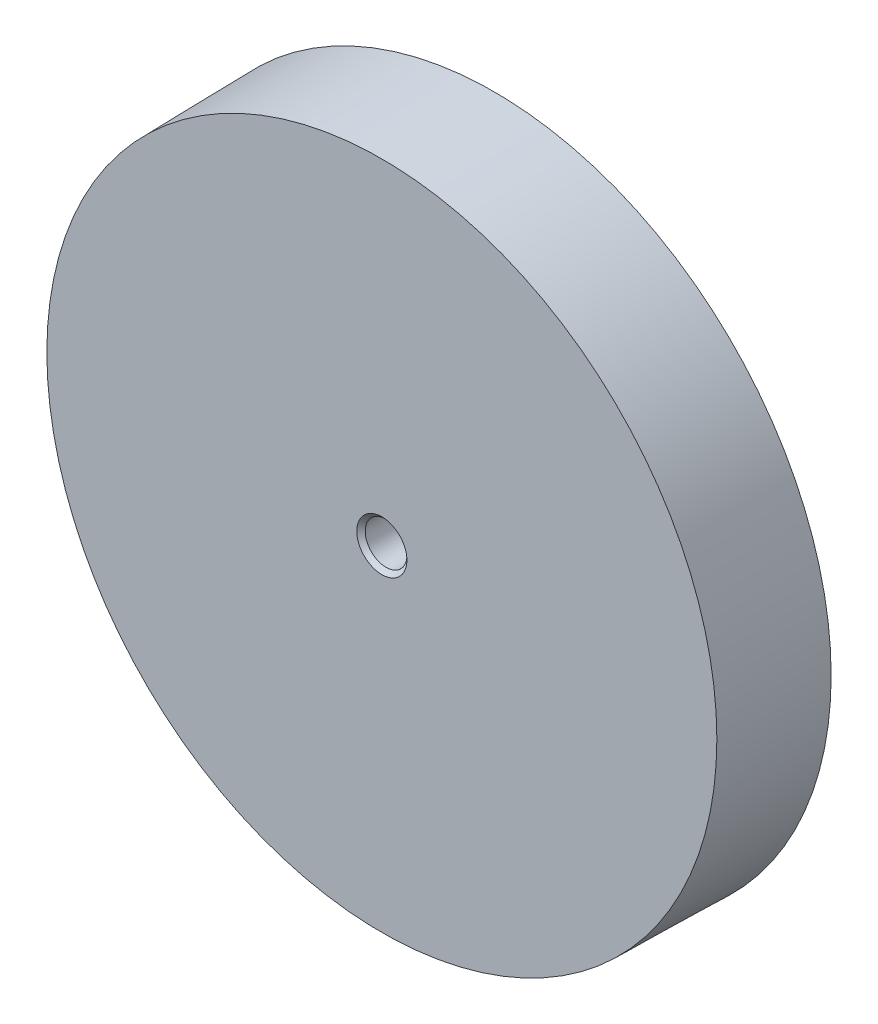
ISO-10303-21;
HEADER;
FILE_DESCRIPTION(('STEP AP214'),'2;1');
FILE_NAME('part.step','',(''),(''),'','','');
FILE_SCHEMA(('AUTOMOTIVE_DESIGN { 1 0 10303 214 1 1 1 1 }'));
ENDSEC;
DATA;
#1=APPLICATION_CONTEXT('core data for automotive mechanical design processes');
#2=APPLICATION_PROTOCOL_DEFINITION('international standard','automotive_design',2000,#1);
#3=PRODUCT_CONTEXT('',#1,'mechanical');
#4=PRODUCT('Part','Part','',(#3));
#5=PRODUCT_RELATED_PRODUCT_CATEGORY('part','',(#4));
#6=PRODUCT_DEFINITION_FORMATION('','',#4);
#7=PRODUCT_DEFINITION_CONTEXT('part definition',#1,'design');
#8=PRODUCT_DEFINITION('design','',#6,#7);
#9=PRODUCT_DEFINITION_SHAPE('','',#8);
#10=(LENGTH_UNIT() NAMED_UNIT(*) SI_UNIT(.MILLI.,.METRE.));
#11=(NAMED_UNIT(*) PLANE_ANGLE_UNIT() SI_UNIT($,.RADIAN.));
#12=(NAMED_UNIT(*) SI_UNIT($,.STERADIAN.) SOLID_ANGLE_UNIT());
#13=UNCERTAINTY_MEASURE_WITH_UNIT(LENGTH_MEASURE(1.E-05),#10,'distance_accuracy_value','');
#14=(GEOMETRIC_REPRESENTATION_CONTEXT(3) GLOBAL_UNCERTAINTY_ASSIGNED_CONTEXT((#13)) GLOBAL_UNIT_ASSIGNED_CONTEXT((#10,
#11,#12)) REPRESENTATION_CONTEXT('',''));
#15=CARTESIAN_POINT('',(0.,0.,0.));
#16=DIRECTION('',(0.,0.,1.));
#17=DIRECTION('',(1.,0.,0.));
#18=AXIS2_PLACEMENT_3D('',#15,#16,#17);
#19=CARTESIAN_POINT('',(-35.1782318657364,-55.27820470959,6.03));
#20=DIRECTION('',(0.,0.,-1.));
#21=DIRECTION('',(1.,0.,0.));
#22=AXIS2_PLACEMENT_3D('',#19,#20,#21);
#23=PLANE('',#22);
#24=DIRECTION('',(-0.866025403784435,-0.500000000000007,0.));
#25=VECTOR('',#24,1.);
#26=CARTESIAN_POINT('',(-35.6807318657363,-54.4078491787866,6.03));
#27=LINE('',#26,#25);
#28=CARTESIAN_POINT('',(-38.5999930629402,-56.0932854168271,6.03));
#29=VERTEX_POINT('',#28);
#30=CARTESIAN_POINT('',(-48.6333332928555,-61.8860370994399,6.03));
#31=VERTEX_POINT('',#30);
#32=EDGE_CURVE('E1919',#29,#31,#27,.T.);
#33=ORIENTED_EDGE('',*,*,#32,.T.);
#34=CARTESIAN_POINT('',(-49.10392035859,-63.3182047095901,6.03));
#35=DIRECTION('',(0.,0.,-1.));
#36=DIRECTION('',(1.,0.,0.));
#37=AXIS2_PLACEMENT_3D('',#34,#35,#36);
#38=CIRCLE('',#37,1.5075);
#39=CARTESIAN_POINT('',(-50.5795074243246,-63.0096612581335,6.03));
#40=VERTEX_POINT('',#39);
#41=EDGE_CURVE('E329',#31,#40,#38,.F.);
#42=ORIENTED_EDGE('',*,*,#41,.T.);
#43=CARTESIAN_POINT('',(-54.8087625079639,-65.4514228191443,6.03));
#44=VERTEX_POINT('',#43);
#45=EDGE_CURVE('E337',#40,#44,#27,.T.);
#46=ORIENTED_EDGE('',*,*,#45,.T.);
#47=CARTESIAN_POINT('',(-35.1782318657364,-55.27820470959,6.03));
#48=DIRECTION('',(0.,0.,-1.));
#49=DIRECTION('',(1.,0.,0.));
#50=AXIS2_PLACEMENT_3D('',#47,#48,#49);
#51=CIRCLE('',#50,22.11);
#52=CARTESIAN_POINT('',(-54.7156821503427,-44.9273527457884,6.03));
#53=VERTEX_POINT('',#52);
#54=EDGE_CURVE('E790',#44,#53,#51,.T.);
#55=ORIENTED_EDGE('',*,*,#54,.T.);
#56=DIRECTION('',(0.860907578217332,-0.508761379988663,0.));
#57=VECTOR('',#56,1.);
#58=CARTESIAN_POINT('',(-35.701631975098,-56.1638834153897,6.03));
#59=LINE('',#58,#57);
#60=CARTESIAN_POINT('',(-50.6068497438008,-47.3555056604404,6.03));
#61=VERTEX_POINT('',#60);
#62=EDGE_CURVE('E971',#53,#61,#59,.T.);
#63=ORIENTED_EDGE('',*,*,#62,.T.);
#64=CARTESIAN_POINT('',(-49.1039203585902,-47.2382047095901,6.03));
#65=DIRECTION('',(0.,0.,-1.));
#66=DIRECTION('',(1.,0.,0.));
#67=AXIS2_PLACEMENT_3D('',#64,#65,#66);
#68=CIRCLE('',#67,1.5075);
#69=CARTESIAN_POINT('',(-48.4817766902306,-48.6113374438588,6.03));
#70=VERTEX_POINT('',#69);
#71=EDGE_CURVE('E1988',#61,#70,#68,.F.);
#72=ORIENTED_EDGE('',*,*,#71,.T.);
#73=CARTESIAN_POINT('',(-38.5974609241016,-54.452566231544,6.03));
#74=VERTEX_POINT('',#73);
#75=EDGE_CURVE('E961',#70,#74,#59,.T.);
#76=ORIENTED_EDGE('',*,*,#75,.T.);
#77=CARTESIAN_POINT('',(-35.1782318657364,-55.27820470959,6.03));
#78=DIRECTION('',(0.,0.,-1.));
#79=DIRECTION('',(1.,0.,0.));
#80=AXIS2_PLACEMENT_3D('',#77,#78,#79);
#81=CIRCLE('',#80,3.5175);
#82=EDGE_CURVE('E894',#29,#74,#81,.T.);
#83=ORIENTED_EDGE('',*,*,#82,.F.);
#84=EDGE_LOOP('',(#33,#42,#46,#55,#63,#72,#76,#83));
#85=FACE_BOUND('',#84,.T.);
#86=ADVANCED_FACE('F16',(#85),#23,.T.);
#87=DIRECTION('',(0.871054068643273,0.491187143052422,0.));
#88=VECTOR('',#87,1.);
#89=CARTESIAN_POINT('',(-34.6729116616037,-56.1743218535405,6.03));
#90=LINE('',#89,#88);
#91=CARTESIAN_POINT('',(-53.9110577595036,-67.0227069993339,6.03));
#92=VERTEX_POINT('',#91);
#93=CARTESIAN_POINT('',(-49.7537994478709,-64.6784302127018,6.03));
#94=VERTEX_POINT('',#93);
#95=EDGE_CURVE('E440',#92,#94,#90,.T.);
#96=ORIENTED_EDGE('',*,*,#95,.T.);
#97=CARTESIAN_POINT('',(-49.10392035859,-63.3182047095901,6.03));
#98=DIRECTION('',(0.,0.,-1.));
#99=DIRECTION('',(1.,0.,0.));
#100=AXIS2_PLACEMENT_3D('',#97,#98,#99);
#101=CIRCLE('',#100,1.5075);
#102=CARTESIAN_POINT('',(-47.6036806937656,-63.4659788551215,6.03));
#103=VERTEX_POINT('',#102);
#104=EDGE_CURVE('E1903',#94,#103,#101,.F.);
#105=ORIENTED_EDGE('',*,*,#104,.T.);
#106=CARTESIAN_POINT('',(-37.6028702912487,-57.8265246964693,6.03));
#107=VERTEX_POINT('',#106);
#108=EDGE_CURVE('E431',#103,#107,#90,.T.);
#109=ORIENTED_EDGE('',*,*,#108,.T.);
#110=CARTESIAN_POINT('',(-36.1832318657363,-58.6490771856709,6.03));
#111=VERTEX_POINT('',#110);
#112=EDGE_CURVE('E882',#111,#107,#81,.T.);
#113=ORIENTED_EDGE('',*,*,#112,.F.);
#114=DIRECTION('',(0.,-1.,0.));
#115=VECTOR('',#114,1.);
#116=CARTESIAN_POINT('',(-36.1832318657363,-55.27820470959,6.03));
#117=LINE('',#116,#115);
#118=CARTESIAN_POINT('',(-36.1832318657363,-70.234580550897,6.03));
#119=VERTEX_POINT('',#118);
#120=EDGE_CURVE('E397',#111,#119,#117,.T.);
#121=ORIENTED_EDGE('',*,*,#120,.T.);
#122=CARTESIAN_POINT('',(-35.1782318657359,-71.3582047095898,6.03));
#123=DIRECTION('',(0.,0.,-1.));
#124=DIRECTION('',(1.,0.,0.));
#125=AXIS2_PLACEMENT_3D('',#122,#123,#124);
#126=CIRCLE('',#125,1.50749999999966);
#127=CARTESIAN_POINT('',(-36.1832318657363,-72.4818288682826,6.03));
#128=VERTEX_POINT('',#127);
#129=EDGE_CURVE('E2037',#119,#128,#126,.F.);
#130=ORIENTED_EDGE('',*,*,#129,.T.);
#131=CARTESIAN_POINT('',(-36.1832318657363,-77.3653519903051,6.03));
#132=VERTEX_POINT('',#131);
#133=EDGE_CURVE('E2043',#128,#132,#117,.T.);
#134=ORIENTED_EDGE('',*,*,#133,.T.);
#135=EDGE_CURVE('E775',#132,#92,#51,.T.);
#136=ORIENTED_EDGE('',*,*,#135,.T.);
#137=EDGE_LOOP('',(#96,#105,#109,#113,#121,#130,#134,#136));
#138=FACE_BOUND('',#137,.T.);
#139=ADVANCED_FACE('F996',(#138),#23,.T.);
#140=CARTESIAN_POINT('',(-34.6729116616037,-56.1743218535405,6.03));
#141=DIRECTION('',(0.490513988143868,-0.86986031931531,-0.0523359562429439));
#142=DIRECTION('',(-0.871054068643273,-0.491187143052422,0.));
#143=AXIS2_PLACEMENT_3D('',#140,#141,#142);
#144=PLANE('',#143);
#145=CARTESIAN_POINT('',(-49.10392035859,-63.3182047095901,-10.4869697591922));
#146=DIRECTION('',(0.490513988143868,-0.86986031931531,-0.0523359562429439));
#147=DIRECTION('',(0.025706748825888,-0.0455874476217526,0.998629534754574));
#148=AXIS2_PLACEMENT_3D('',#145,#146,#147);
#149=ELLIPSE('',#148,28.8042888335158,1.5075);
#150=CARTESIAN_POINT('',(-50.0567014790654,-64.4864360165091,0.));
#151=VERTEX_POINT('',#150);
#152=EDGE_CURVE('E1899',#94,#151,#149,.T.);
#153=ORIENTED_EDGE('',*,*,#152,.F.);
#154=ORIENTED_EDGE('',*,*,#95,.F.);
#155=CARTESIAN_POINT('',(-53.9110577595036,-67.0227069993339,6.03));
#156=CARTESIAN_POINT('',(-53.9849892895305,-67.0039315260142,5.02502191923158));
#157=CARTESIAN_POINT('',(-54.0587454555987,-66.9850565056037,4.02003287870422));
#158=CARTESIAN_POINT('',(-54.2059070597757,-66.9471073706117,2.01003287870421));
#159=CARTESIAN_POINT('',(-54.2793124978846,-66.9280332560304,1.00502191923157));
#160=CARTESIAN_POINT('',(-54.352542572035,-66.9088595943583,0.));
#161=B_SPLINE_CURVE_WITH_KNOTS('',3,(#155,#156,#157,#158,#159,#160),.UNSPECIFIED.,.F.,.F.,(4,2,
4),(0.,3.02360594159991,6.04721188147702),.UNSPECIFIED.);
#162=CARTESIAN_POINT('',(-54.352542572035,-66.9088595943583,0.));
#163=VERTEX_POINT('',#162);
#164=EDGE_CURVE('E433',#92,#163,#161,.T.);
#165=ORIENTED_EDGE('',*,*,#164,.T.);
#166=DIRECTION('',(0.871054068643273,0.491187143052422,0.));
#167=VECTOR('',#166,1.);
#168=CARTESIAN_POINT('',(-34.8281360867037,-55.899052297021,0.));
#169=LINE('',#168,#167);
#170=EDGE_CURVE('E396',#151,#163,#169,.F.);
#171=ORIENTED_EDGE('',*,*,#170,.F.);
#172=EDGE_LOOP('',(#153,#154,#165,#171));
#173=FACE_BOUND('',#172,.T.);
#174=ADVANCED_FACE('F420',(#173),#144,.T.);
#175=CARTESIAN_POINT('',(-47.611227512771,-63.1074339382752,0.));
#176=VERTEX_POINT('',#175);
#177=EDGE_CURVE('E1905',#176,#103,#149,.T.);
#178=ORIENTED_EDGE('',*,*,#177,.F.);
#179=CARTESIAN_POINT('',(-37.5468104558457,-57.4321120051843,0.));
#180=VERTEX_POINT('',#179);
#181=EDGE_CURVE('E362',#180,#176,#169,.F.);
#182=ORIENTED_EDGE('',*,*,#181,.F.);
#183=CARTESIAN_POINT('',(-37.6028702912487,-57.8265246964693,6.03));
#184=CARTESIAN_POINT('',(-37.5988329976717,-57.7940129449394,5.52747104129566));
#185=CARTESIAN_POINT('',(-37.5946487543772,-57.7614187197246,5.02494858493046));
#186=CARTESIAN_POINT('',(-37.585969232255,-57.6960557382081,4.01991799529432));
#187=CARTESIAN_POINT('',(-37.5814739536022,-57.6632869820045,3.51740986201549));
#188=CARTESIAN_POINT('',(-37.5721552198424,-57.5975653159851,2.51240863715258));
#189=CARTESIAN_POINT('',(-37.5673317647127,-57.5646124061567,2.00991554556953));
#190=CARTESIAN_POINT('',(-37.557336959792,-57.498511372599,1.00494538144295));
#191=CARTESIAN_POINT('',(-37.5521656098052,-57.4653632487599,0.502468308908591));
#192=CARTESIAN_POINT('',(-37.5468104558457,-57.4321120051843,0.));
#193=B_SPLINE_CURVE_WITH_KNOTS('',3,(#183,#184,#185,#186,#187,#188,#189,#190,#191,#192),
.UNSPECIFIED.,.F.,.F.,(4,2,2,2,4),(0.,1.51078720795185,3.02157356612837,4.53236002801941,
6.04314733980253),.UNSPECIFIED.);
#194=EDGE_CURVE('E424',#107,#180,#193,.T.);
#195=ORIENTED_EDGE('',*,*,#194,.F.);
#196=ORIENTED_EDGE('',*,*,#108,.F.);
#197=EDGE_LOOP('',(#178,#182,#195,#196));
#198=FACE_BOUND('',#197,.T.);
#199=ADVANCED_FACE('F1693',(#198),#144,.T.);
#200=CARTESIAN_POINT('',(-35.6807318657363,-54.4078491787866,6.03));
#201=DIRECTION('',(-0.499314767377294,0.864838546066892,-0.052335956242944));
#202=DIRECTION('',(0.866025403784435,0.500000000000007,0.));
#203=AXIS2_PLACEMENT_3D('',#200,#201,#202);
#204=PLANE('',#203);
#205=CARTESIAN_POINT('',(-49.10392035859,-63.3182047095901,-13.1465423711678));
#206=DIRECTION('',(-0.499314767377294,0.864838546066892,-0.052335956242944));
#207=DIRECTION('',(-0.0261679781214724,0.04532426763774,0.998629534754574));
#208=AXIS2_PLACEMENT_3D('',#205,#206,#207);
#209=ELLIPSE('',#208,28.8042888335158,1.5075);
#210=CARTESIAN_POINT('',(-48.2872063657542,-62.0511078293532,0.));
#211=VERTEX_POINT('',#210);
#212=EDGE_CURVE('E326',#31,#211,#209,.T.);
#213=ORIENTED_EDGE('',*,*,#212,.F.);
#214=ORIENTED_EDGE('',*,*,#32,.F.);
#215=CARTESIAN_POINT('',(-38.2303209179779,-56.2447623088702,0.));
#216=CARTESIAN_POINT('',(-38.261813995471,-56.2325378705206,0.502467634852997));
#217=CARTESIAN_POINT('',(-38.2931222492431,-56.2202061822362,1.00494422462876));
#218=CARTESIAN_POINT('',(-38.3553890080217,-56.1953398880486,2.00991376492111));
#219=CARTESIAN_POINT('',(-38.3863475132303,-56.1828052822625,2.51240671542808));
#220=CARTESIAN_POINT('',(-38.4479347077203,-56.1575447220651,3.51740797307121));
#221=CARTESIAN_POINT('',(-38.4785633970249,-56.1448187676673,4.01991628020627));
#222=CARTESIAN_POINT('',(-38.5395082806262,-56.1191855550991,5.02494751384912));
#223=CARTESIAN_POINT('',(-38.5698244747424,-56.106278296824,5.52747044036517));
#224=CARTESIAN_POINT('',(-38.5999930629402,-56.0932854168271,6.03));
#225=B_SPLINE_CURVE_WITH_KNOTS('',3,(#215,#216,#217,#218,#219,#220,#221,#222,#223,#224),
.UNSPECIFIED.,.F.,.F.,(4,2,2,2,4),(0.,1.51080592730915,3.02161098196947,4.53241593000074,
6.04322175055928),.UNSPECIFIED.);
#226=CARTESIAN_POINT('',(-38.2303209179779,-56.2447623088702,0.));
#227=VERTEX_POINT('',#226);
#228=EDGE_CURVE('E346',#227,#29,#225,.T.);
#229=ORIENTED_EDGE('',*,*,#228,.F.);
#230=DIRECTION('',(-0.866025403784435,-0.500000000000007,0.));
#231=VECTOR('',#230,1.);
#232=CARTESIAN_POINT('',(-35.522722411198,-54.6815295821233,0.));
#233=LINE('',#232,#231);
#234=EDGE_CURVE('E347',#211,#227,#233,.F.);
#235=ORIENTED_EDGE('',*,*,#234,.F.);
#236=EDGE_LOOP('',(#213,#214,#229,#235));
#237=FACE_BOUND('',#236,.T.);
#238=ADVANCED_FACE('F1687',(#237),#204,.T.);
#239=CARTESIAN_POINT('',(-50.6096154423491,-63.3919513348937,0.));
#240=VERTEX_POINT('',#239);
#241=EDGE_CURVE('E323',#240,#40,#209,.T.);
#242=ORIENTED_EDGE('',*,*,#241,.F.);
#243=CARTESIAN_POINT('',(-54.9350566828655,-65.8892459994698,0.));
#244=VERTEX_POINT('',#243);
#245=EDGE_CURVE('E335',#244,#240,#233,.F.);
#246=ORIENTED_EDGE('',*,*,#245,.F.);
#247=CARTESIAN_POINT('',(-54.9350566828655,-65.8892459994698,0.));
#248=CARTESIAN_POINT('',(-54.9143567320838,-65.8164756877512,1.00502184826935));
#249=CARTESIAN_POINT('',(-54.8934822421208,-65.7436052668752,2.0100327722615));
#250=CARTESIAN_POINT('',(-54.8513841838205,-65.5976642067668,4.02003277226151));
#251=CARTESIAN_POINT('',(-54.8301606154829,-65.5245935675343,5.02502184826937));
#252=CARTESIAN_POINT('',(-54.8087625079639,-65.4514228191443,6.03));
#253=B_SPLINE_CURVE_WITH_KNOTS('',3,(#247,#248,#249,#250,#251,#252),.UNSPECIFIED.,.F.,.F.,(4,2,
4),(0.,3.02359640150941,6.04719280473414),.UNSPECIFIED.);
#254=EDGE_CURVE('E432',#244,#44,#253,.T.);
#255=ORIENTED_EDGE('',*,*,#254,.T.);
#256=ORIENTED_EDGE('',*,*,#45,.F.);
#257=EDGE_LOOP('',(#242,#246,#255,#256));
#258=FACE_BOUND('',#257,.T.);
#259=ADVANCED_FACE('F333',(#258),#204,.T.);
#260=DIRECTION('',(-0.86602540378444,0.5,0.));
#261=VECTOR('',#260,1.);
#262=CARTESIAN_POINT('',(-34.6757318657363,-54.4078491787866,6.03));
#263=LINE('',#262,#261);
#264=CARTESIAN_POINT('',(-37.5949930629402,-52.7224129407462,6.03));
#265=VERTEX_POINT('',#264);
#266=CARTESIAN_POINT('',(-47.6283332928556,-46.9296612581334,6.03));
#267=VERTEX_POINT('',#266);
#268=EDGE_CURVE('E682',#265,#267,#263,.T.);
#269=ORIENTED_EDGE('',*,*,#268,.T.);
#270=CARTESIAN_POINT('',(-49.1039203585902,-47.2382047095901,6.03));
#271=DIRECTION('',(0.,0.,-1.));
#272=DIRECTION('',(1.,0.,0.));
#273=AXIS2_PLACEMENT_3D('',#270,#271,#272);
#274=CIRCLE('',#273,1.5075);
#275=CARTESIAN_POINT('',(-49.5745074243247,-45.8060370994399,6.03));
#276=VERTEX_POINT('',#275);
#277=EDGE_CURVE('E1942',#267,#276,#274,.F.);
#278=ORIENTED_EDGE('',*,*,#277,.T.);
#279=CARTESIAN_POINT('',(-53.803762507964,-43.3642755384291,6.03));
#280=VERTEX_POINT('',#279);
#281=EDGE_CURVE('E672',#276,#280,#263,.T.);
#282=ORIENTED_EDGE('',*,*,#281,.T.);
#283=CARTESIAN_POINT('',(-35.9828562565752,-33.1828504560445,6.03));
#284=VERTEX_POINT('',#283);
#285=EDGE_CURVE('E807',#280,#284,#51,.T.);
#286=ORIENTED_EDGE('',*,*,#285,.T.);
#287=DIRECTION('',(-0.010146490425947,-0.999948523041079,0.));
#288=VECTOR('',#287,1.);
#289=CARTESIAN_POINT('',(-36.2069521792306,-55.2677662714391,6.03));
#290=LINE('',#289,#288);
#291=CARTESIAN_POINT('',(-36.0312821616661,-37.9552801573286,6.03));
#292=VERTEX_POINT('',#291);
#293=EDGE_CURVE('E643',#284,#292,#290,.T.);
#294=ORIENTED_EDGE('',*,*,#293,.T.);
#295=CARTESIAN_POINT('',(-35.1782318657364,-39.19820470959,6.03));
#296=DIRECTION('',(0.,0.,-1.));
#297=DIRECTION('',(1.,0.,0.));
#298=AXIS2_PLACEMENT_3D('',#295,#296,#297);
#299=CIRCLE('',#298,1.5075);
#300=CARTESIAN_POINT('',(-36.0563278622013,-40.4235632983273,6.03));
#301=VERTEX_POINT('',#300);
#302=EDGE_CURVE('E1952',#292,#301,#299,.F.);
#303=ORIENTED_EDGE('',*,*,#302,.T.);
#304=CARTESIAN_POINT('',(-36.1728224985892,-51.9042462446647,6.03));
#305=VERTEX_POINT('',#304);
#306=EDGE_CURVE('E1045',#301,#305,#290,.T.);
#307=ORIENTED_EDGE('',*,*,#306,.T.);
#308=EDGE_CURVE('E912',#265,#305,#81,.T.);
#309=ORIENTED_EDGE('',*,*,#308,.F.);
#310=EDGE_LOOP('',(#269,#278,#282,#286,#294,#303,#307,#309));
#311=FACE_BOUND('',#310,.T.);
#312=ADVANCED_FACE('F986',(#311),#23,.T.);
#313=CARTESIAN_POINT('',(-35.701631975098,-56.1638834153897,6.03));
#314=DIRECTION('',(-0.508064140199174,-0.859727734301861,-0.052335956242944));
#315=DIRECTION('',(-0.860907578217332,0.508761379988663,0.));
#316=AXIS2_PLACEMENT_3D('',#313,#314,#315);
#317=PLANE('',#316);
#318=CARTESIAN_POINT('',(-49.1039203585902,-47.2382047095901,-10.4869697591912));
#319=DIRECTION('',(-0.508064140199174,-0.859727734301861,-0.052335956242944));
#320=DIRECTION('',(-0.0266265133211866,-0.0450564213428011,0.998629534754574));
#321=AXIS2_PLACEMENT_3D('',#318,#319,#320);
#322=ELLIPSE('',#321,28.8042888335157,1.5075);
#323=CARTESIAN_POINT('',(-50.592028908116,-46.9971877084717,0.));
#324=VERTEX_POINT('',#323);
#325=EDGE_CURVE('E1990',#61,#324,#322,.T.);
#326=ORIENTED_EDGE('',*,*,#325,.F.);
#327=ORIENTED_EDGE('',*,*,#62,.F.);
#328=CARTESIAN_POINT('',(-54.7156821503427,-44.9273527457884,6.03));
#329=CARTESIAN_POINT('',(-54.7363878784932,-44.8539384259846,5.02502191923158));
#330=CARTESIAN_POINT('',(-54.7569197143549,-44.7806262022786,4.02003287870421));
#331=CARTESIAN_POINT('',(-54.7976356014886,-44.6342059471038,2.0100328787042));
#332=CARTESIAN_POINT('',(-54.817819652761,-44.5610979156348,1.00502191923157));
#333=CARTESIAN_POINT('',(-54.8378298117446,-44.4880919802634,0.));
#334=B_SPLINE_CURVE_WITH_KNOTS('',3,(#328,#329,#330,#331,#332,#333),.UNSPECIFIED.,.F.,.F.,(4,2,
4),(0.,3.0236059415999,6.04721188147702),.UNSPECIFIED.);
#335=CARTESIAN_POINT('',(-54.8378298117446,-44.4880919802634,0.));
#336=VERTEX_POINT('',#335);
#337=EDGE_CURVE('E365',#53,#336,#334,.T.);
#338=ORIENTED_EDGE('',*,*,#337,.T.);
#339=DIRECTION('',(0.860907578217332,-0.508761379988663,0.));
#340=VECTOR('',#339,1.);
#341=CARTESIAN_POINT('',(-35.5408537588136,-55.8918203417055,0.));
#342=LINE('',#341,#340);
#343=EDGE_CURVE('E382',#324,#336,#342,.F.);
#344=ORIENTED_EDGE('',*,*,#343,.F.);
#345=EDGE_LOOP('',(#326,#327,#338,#344));
#346=FACE_BOUND('',#345,.T.);
#347=ADVANCED_FACE('F983',(#346),#317,.T.);
#348=CARTESIAN_POINT('',(-48.1750410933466,-48.4255292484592,0.));
#349=VERTEX_POINT('',#348);
#350=EDGE_CURVE('E1978',#349,#70,#322,.T.);
#351=ORIENTED_EDGE('',*,*,#350,.F.);
#352=CARTESIAN_POINT('',(-38.2278595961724,-54.3039091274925,0.));
#353=VERTEX_POINT('',#352);
#354=EDGE_CURVE('E377',#353,#349,#342,.F.);
#355=ORIENTED_EDGE('',*,*,#354,.F.);
#356=CARTESIAN_POINT('',(-38.5974609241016,-54.452566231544,6.03));
#357=CARTESIAN_POINT('',(-38.5672862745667,-54.4398067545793,5.52747104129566));
#358=CARTESIAN_POINT('',(-38.5369667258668,-54.4271333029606,5.02494858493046));
#359=CARTESIAN_POINT('',(-38.4760209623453,-54.4019684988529,4.01991799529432));
#360=CARTESIAN_POINT('',(-38.4453947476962,-54.3894771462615,3.51740986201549));
#361=CARTESIAN_POINT('',(-38.3838187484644,-54.364686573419,2.51240863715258));
#362=CARTESIAN_POINT('',(-38.3528689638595,-54.352387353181,2.00991554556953));
#363=CARTESIAN_POINT('',(-38.2906263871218,-54.3279925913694,1.00494538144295));
#364=CARTESIAN_POINT('',(-38.259333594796,-54.3158970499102,0.502468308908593));
#365=CARTESIAN_POINT('',(-38.2278595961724,-54.3039091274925,0.));
#366=B_SPLINE_CURVE_WITH_KNOTS('',3,(#356,#357,#358,#359,#360,#361,#362,#363,#364,#365),
.UNSPECIFIED.,.F.,.F.,(4,2,2,2,4),(0.,1.51078720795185,3.02157356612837,4.5323600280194,
6.04314733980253),.UNSPECIFIED.);
#367=EDGE_CURVE('E681',#74,#353,#366,.T.);
#368=ORIENTED_EDGE('',*,*,#367,.F.);
#369=ORIENTED_EDGE('',*,*,#75,.F.);
#370=EDGE_LOOP('',(#351,#355,#368,#369));
#371=FACE_BOUND('',#370,.T.);
#372=ADVANCED_FACE('F960',(#371),#317,.T.);
#373=CARTESIAN_POINT('',(-34.6757318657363,-54.4078491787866,6.03));
#374=DIRECTION('',(0.499314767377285,0.864838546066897,-0.0523359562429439));
#375=DIRECTION('',(0.86602540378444,-0.5,0.));
#376=AXIS2_PLACEMENT_3D('',#373,#374,#375);
#377=PLANE('',#376);
#378=CARTESIAN_POINT('',(-49.1039203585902,-47.2382047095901,-13.1465423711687));
#379=DIRECTION('',(0.499314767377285,0.864838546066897,-0.0523359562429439));
#380=DIRECTION('',(0.0261679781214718,0.0453242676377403,0.998629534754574));
#381=AXIS2_PLACEMENT_3D('',#378,#379,#380);
#382=ELLIPSE('',#381,28.8042888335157,1.5075);
#383=CARTESIAN_POINT('',(-47.5982252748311,-47.3119513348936,0.));
#384=VERTEX_POINT('',#383);
#385=EDGE_CURVE('E339',#267,#384,#382,.T.);
#386=ORIENTED_EDGE('',*,*,#385,.F.);
#387=ORIENTED_EDGE('',*,*,#268,.F.);
#388=CARTESIAN_POINT('',(-37.5413398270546,-53.1182968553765,0.));
#389=CARTESIAN_POINT('',(-37.5464996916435,-53.0849108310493,0.502467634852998));
#390=CARTESIAN_POINT('',(-37.5514742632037,-53.0516312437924,1.00494422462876));
#391=CARTESIAN_POINT('',(-37.5610728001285,-52.9852735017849,2.00991376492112));
#392=CARTESIAN_POINT('',(-37.5656967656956,-52.9521953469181,2.51240671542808));
#393=CARTESIAN_POINT('',(-37.5746140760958,-52.8862289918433,3.51740797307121));
#394=CARTESIAN_POINT('',(-37.5789074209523,-52.8533407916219,4.01991628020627));
#395=CARTESIAN_POINT('',(-37.5871808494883,-52.7877443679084,5.02494751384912));
#396=CARTESIAN_POINT('',(-37.5911609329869,-52.7550361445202,5.52747044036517));
#397=CARTESIAN_POINT('',(-37.5949930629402,-52.7224129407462,6.03));
#398=B_SPLINE_CURVE_WITH_KNOTS('',3,(#388,#389,#390,#391,#392,#393,#394,#395,#396,#397),
.UNSPECIFIED.,.F.,.F.,(4,2,2,2,4),(0.,1.51080592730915,3.02161098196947,4.53241593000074,
6.04322175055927),.UNSPECIFIED.);
#399=CARTESIAN_POINT('',(-37.5413398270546,-53.1182968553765,0.));
#400=VERTEX_POINT('',#399);
#401=EDGE_CURVE('E665',#400,#265,#398,.T.);
#402=ORIENTED_EDGE('',*,*,#401,.F.);
#403=DIRECTION('',(-0.86602540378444,0.5,0.));
#404=VECTOR('',#403,1.);
#405=CARTESIAN_POINT('',(-34.8337413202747,-54.6815295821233,0.));
#406=LINE('',#405,#404);
#407=EDGE_CURVE('E381',#384,#400,#406,.F.);
#408=ORIENTED_EDGE('',*,*,#407,.F.);
#409=EDGE_LOOP('',(#386,#387,#402,#408));
#410=FACE_BOUND('',#409,.T.);
#411=ADVANCED_FACE('F662',(#410),#377,.T.);
#412=CARTESIAN_POINT('',(-49.9206343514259,-45.9711078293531,0.));
#413=VERTEX_POINT('',#412);
#414=EDGE_CURVE('E713',#413,#276,#382,.T.);
#415=ORIENTED_EDGE('',*,*,#414,.F.);
#416=CARTESIAN_POINT('',(-54.2460755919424,-43.4738131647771,0.));
#417=VERTEX_POINT('',#416);
#418=EDGE_CURVE('E673',#417,#413,#406,.F.);
#419=ORIENTED_EDGE('',*,*,#418,.F.);
#420=CARTESIAN_POINT('',(-54.2460755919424,-43.4738131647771,0.));
#421=CARTESIAN_POINT('',(-54.1727046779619,-43.4553546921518,1.00502184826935));
#422=CARTESIAN_POINT('',(-54.0991597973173,-43.4369973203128,2.01003277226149));
#423=CARTESIAN_POINT('',(-53.951722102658,-43.4004847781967,4.02003277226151));
#424=CARTESIAN_POINT('',(-53.8778292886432,-43.3823296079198,5.02502184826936));
#425=CARTESIAN_POINT('',(-53.803762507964,-43.3642755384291,6.03));
#426=B_SPLINE_CURVE_WITH_KNOTS('',3,(#420,#421,#422,#423,#424,#425),.UNSPECIFIED.,.F.,.F.,(4,2,
4),(0.,3.02359640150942,6.04719280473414),.UNSPECIFIED.);
#427=EDGE_CURVE('E674',#417,#280,#426,.T.);
#428=ORIENTED_EDGE('',*,*,#427,.T.);
#429=ORIENTED_EDGE('',*,*,#281,.F.);
#430=EDGE_LOOP('',(#415,#419,#428,#429));
#431=FACE_BOUND('',#430,.T.);
#432=ADVANCED_FACE('F1017',(#431),#377,.T.);
#433=DIRECTION('',(0.,1.,0.));
#434=VECTOR('',#433,1.);
#435=CARTESIAN_POINT('',(-34.1732318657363,-55.27820470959,6.03));
#436=LINE('',#435,#434);
#437=CARTESIAN_POINT('',(-34.1732318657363,-51.907332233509,6.03));
#438=VERTEX_POINT('',#437);
#439=CARTESIAN_POINT('',(-34.1732318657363,-40.3218288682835,6.03));
#440=VERTEX_POINT('',#439);
#441=EDGE_CURVE('E620',#438,#440,#436,.T.);
#442=ORIENTED_EDGE('',*,*,#441,.T.);
#443=CARTESIAN_POINT('',(-35.1782318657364,-39.19820470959,6.03));
#444=DIRECTION('',(0.,0.,-1.));
#445=DIRECTION('',(1.,0.,0.));
#446=AXIS2_PLACEMENT_3D('',#443,#444,#445);
#447=CIRCLE('',#446,1.5075);
#448=CARTESIAN_POINT('',(-34.1732318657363,-38.0745805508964,6.03));
#449=VERTEX_POINT('',#448);
#450=EDGE_CURVE('E1025',#440,#449,#447,.F.);
#451=ORIENTED_EDGE('',*,*,#450,.T.);
#452=CARTESIAN_POINT('',(-34.1732318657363,-33.1910574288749,6.03));
#453=VERTEX_POINT('',#452);
#454=EDGE_CURVE('E610',#449,#453,#436,.T.);
#455=ORIENTED_EDGE('',*,*,#454,.T.);
#456=CARTESIAN_POINT('',(-16.4454059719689,-43.5337024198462,6.03));
#457=VERTEX_POINT('',#456);
#458=EDGE_CURVE('E793',#453,#457,#51,.T.);
#459=ORIENTED_EDGE('',*,*,#458,.T.);
#460=DIRECTION('',(-0.871054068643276,-0.491187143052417,0.));
#461=VECTOR('',#460,1.);
#462=CARTESIAN_POINT('',(-35.6835520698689,-54.3820875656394,6.03));
#463=LINE('',#462,#461);
#464=CARTESIAN_POINT('',(-20.6026642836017,-45.8779792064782,6.03));
#465=VERTEX_POINT('',#464);
#466=EDGE_CURVE('E579',#457,#465,#463,.T.);
#467=ORIENTED_EDGE('',*,*,#466,.T.);
#468=CARTESIAN_POINT('',(-21.2525433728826,-47.2382047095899,6.03));
#469=DIRECTION('',(0.,0.,-1.));
#470=DIRECTION('',(1.,0.,0.));
#471=AXIS2_PLACEMENT_3D('',#468,#469,#470);
#472=CIRCLE('',#471,1.5075);
#473=CARTESIAN_POINT('',(-22.752783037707,-47.0904305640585,6.03));
#474=VERTEX_POINT('',#473);
#475=EDGE_CURVE('E2014',#465,#474,#472,.F.);
#476=ORIENTED_EDGE('',*,*,#475,.T.);
#477=CARTESIAN_POINT('',(-32.7535934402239,-52.7298847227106,6.03));
#478=VERTEX_POINT('',#477);
#479=EDGE_CURVE('E2504',#474,#478,#463,.T.);
#480=ORIENTED_EDGE('',*,*,#479,.T.);
#481=EDGE_CURVE('E897',#438,#478,#81,.T.);
#482=ORIENTED_EDGE('',*,*,#481,.F.);
#483=EDGE_LOOP('',(#442,#451,#455,#459,#467,#476,#480,#482));
#484=FACE_BOUND('',#483,.T.);
#485=ADVANCED_FACE('F655',(#484),#23,.T.);
#486=CARTESIAN_POINT('',(-36.2069521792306,-55.2677662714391,6.03));
#487=DIRECTION('',(-0.998578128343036,0.0101325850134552,-0.0523359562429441));
#488=DIRECTION('',(0.052338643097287,0.,-0.99862939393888));
#489=AXIS2_PLACEMENT_3D('',#486,#487,#488);
#490=PLANE('',#489);
#491=CARTESIAN_POINT('',(-35.1782318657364,-39.19820470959,-10.4869697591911));
#492=DIRECTION('',(-0.998578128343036,0.0101325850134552,-0.0523359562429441));
#493=DIRECTION('',(-0.0523332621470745,0.000531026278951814,0.998629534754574));
#494=AXIS2_PLACEMENT_3D('',#491,#492,#493);
#495=ELLIPSE('',#494,28.8042888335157,1.5075);
#496=CARTESIAN_POINT('',(-35.7135592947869,-37.7889564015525,0.));
#497=VERTEX_POINT('',#496);
#498=EDGE_CURVE('E1950',#292,#497,#495,.T.);
#499=ORIENTED_EDGE('',*,*,#498,.F.);
#500=ORIENTED_EDGE('',*,*,#293,.F.);
#501=CARTESIAN_POINT('',(-35.9828562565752,-33.1828504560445,6.03));
#502=CARTESIAN_POINT('',(-35.9296304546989,-33.1282116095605,5.02502191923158));
#503=CARTESIAN_POINT('',(-35.8764061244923,-33.073774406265,4.02003287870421));
#504=CARTESIAN_POINT('',(-35.7699604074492,-32.9653032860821,2.0100328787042));
#505=CARTESIAN_POINT('',(-35.7167390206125,-32.9112693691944,1.00502191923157));
#506=CARTESIAN_POINT('',(-35.6635191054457,-32.8574370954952,0.));
#507=B_SPLINE_CURVE_WITH_KNOTS('',3,(#501,#502,#503,#504,#505,#506),.UNSPECIFIED.,.F.,.F.,(4,2,
4),(0.,3.0236059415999,6.04721188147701),.UNSPECIFIED.);
#508=CARTESIAN_POINT('',(-35.6635191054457,-32.8574370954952,0.));
#509=VERTEX_POINT('',#508);
#510=EDGE_CURVE('E635',#284,#509,#507,.T.);
#511=ORIENTED_EDGE('',*,*,#510,.T.);
#512=DIRECTION('',(-0.010146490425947,-0.999948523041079,0.));
#513=VECTOR('',#512,1.);
#514=CARTESIAN_POINT('',(-35.8909495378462,-55.2709727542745,0.));
#515=LINE('',#514,#513);
#516=EDGE_CURVE('E687',#497,#509,#515,.F.);
#517=ORIENTED_EDGE('',*,*,#516,.F.);
#518=EDGE_LOOP('',(#499,#500,#511,#517));
#519=FACE_BOUND('',#518,.T.);
#520=ADVANCED_FACE('F651',(#519),#490,.T.);
#521=CARTESIAN_POINT('',(-35.7420454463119,-40.5963000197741,0.));
#522=VERTEX_POINT('',#521);
#523=EDGE_CURVE('E1955',#522,#301,#495,.T.);
#524=ORIENTED_EDGE('',*,*,#523,.F.);
#525=CARTESIAN_POINT('',(-35.859281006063,-52.1500018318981,0.));
#526=VERTEX_POINT('',#525);
#527=EDGE_CURVE('E683',#526,#522,#515,.F.);
#528=ORIENTED_EDGE('',*,*,#527,.F.);
#529=CARTESIAN_POINT('',(-36.1728224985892,-51.9042462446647,6.03));
#530=CARTESIAN_POINT('',(-36.1466851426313,-51.9239985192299,5.52747104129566));
#531=CARTESIAN_POINT('',(-36.1205498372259,-51.9439192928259,5.02494858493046));
#532=CARTESIAN_POINT('',(-36.0682835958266,-51.9841174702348,4.01991799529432));
#533=CARTESIAN_POINT('',(-36.0421526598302,-52.0043948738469,3.51740986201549));
#534=CARTESIAN_POINT('',(-35.9898953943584,-52.0453259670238,2.51240863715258));
#535=CARTESIAN_POINT('',(-35.9637690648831,-52.0659796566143,2.00991554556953));
#536=CARTESIAN_POINT('',(-35.9115212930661,-52.1076859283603,1.00494538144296));
#537=CARTESIAN_POINT('',(-35.8853998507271,-52.1287385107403,0.502468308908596));
#538=CARTESIAN_POINT('',(-35.859281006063,-52.1500018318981,0.));
#539=B_SPLINE_CURVE_WITH_KNOTS('',3,(#529,#530,#531,#532,#533,#534,#535,#536,#537,#538),
.UNSPECIFIED.,.F.,.F.,(4,2,2,2,4),(0.,1.51078720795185,3.02157356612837,4.5323600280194,
6.04314733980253),.UNSPECIFIED.);
#540=EDGE_CURVE('E619',#305,#526,#539,.T.);
#541=ORIENTED_EDGE('',*,*,#540,.F.);
#542=ORIENTED_EDGE('',*,*,#306,.F.);
#543=EDGE_LOOP('',(#524,#528,#541,#542));
#544=FACE_BOUND('',#543,.T.);
#545=ADVANCED_FACE('F654',(#544),#490,.T.);
#546=CARTESIAN_POINT('',(-34.1732318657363,-55.27820470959,6.03));
#547=DIRECTION('',(0.998629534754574,0.,-0.0523359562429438));
#548=DIRECTION('',(0.0523359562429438,0.,0.998629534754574));
#549=AXIS2_PLACEMENT_3D('',#546,#547,#548);
#550=PLANE('',#549);
#551=CARTESIAN_POINT('',(-35.1782318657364,-39.19820470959,-13.1465423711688));
#552=DIRECTION('',(0.998629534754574,0.,-0.0523359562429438));
#553=DIRECTION('',(0.0523359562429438,0.,0.998629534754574));
#554=AXIS2_PLACEMENT_3D('',#551,#552,#553);
#555=ELLIPSE('',#554,28.8042888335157,1.5075);
#556=CARTESIAN_POINT('',(-34.4892507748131,-40.5390482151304,0.));
#557=VERTEX_POINT('',#556);
#558=EDGE_CURVE('E712',#440,#557,#555,.T.);
#559=ORIENTED_EDGE('',*,*,#558,.F.);
#560=ORIENTED_EDGE('',*,*,#441,.F.);
#561=CARTESIAN_POINT('',(-34.4892507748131,-52.1517392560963,0.));
#562=CARTESIAN_POINT('',(-34.4629175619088,-52.1305776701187,0.502467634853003));
#563=CARTESIAN_POINT('',(-34.436583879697,-52.1096297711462,1.00494422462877));
#564=CARTESIAN_POINT('',(-34.3839156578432,-52.0681383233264,2.00991376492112));
#565=CARTESIAN_POINT('',(-34.3575811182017,-52.0475947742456,2.51240671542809));
#566=CARTESIAN_POINT('',(-34.304911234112,-52.0068889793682,3.51740797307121));
#567=CARTESIAN_POINT('',(-34.2785758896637,-51.9867267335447,4.01991628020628));
#568=CARTESIAN_POINT('',(-34.2259044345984,-51.9467635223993,5.02494751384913));
#569=CARTESIAN_POINT('',(-34.1995683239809,-51.9269625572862,5.52747044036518));
#570=CARTESIAN_POINT('',(-34.1732318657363,-51.907332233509,6.03));
#571=B_SPLINE_CURVE_WITH_KNOTS('',3,(#561,#562,#563,#564,#565,#566,#567,#568,#569,#570),
.UNSPECIFIED.,.F.,.F.,(4,2,2,2,4),(0.,1.51080592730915,3.02161098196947,4.53241593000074,
6.04322175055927),.UNSPECIFIED.);
#572=CARTESIAN_POINT('',(-34.4892507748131,-52.1517392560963,0.));
#573=VERTEX_POINT('',#572);
#574=EDGE_CURVE('E603',#573,#438,#571,.T.);
#575=ORIENTED_EDGE('',*,*,#574,.F.);
#576=DIRECTION('',(0.,1.,0.));
#577=VECTOR('',#576,1.);
#578=CARTESIAN_POINT('',(-34.4892507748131,-55.27820470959,0.));
#579=LINE('',#578,#577);
#580=EDGE_CURVE('E632',#557,#573,#579,.F.);
#581=ORIENTED_EDGE('',*,*,#580,.F.);
#582=EDGE_LOOP('',(#559,#560,#575,#581));
#583=FACE_BOUND('',#582,.T.);
#584=ADVANCED_FACE('F599',(#583),#550,.T.);
#585=CARTESIAN_POINT('',(-34.4892507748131,-37.8573612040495,0.));
#586=VERTEX_POINT('',#585);
#587=EDGE_CURVE('E709',#586,#449,#555,.T.);
#588=ORIENTED_EDGE('',*,*,#587,.F.);
#589=CARTESIAN_POINT('',(-34.4892507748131,-32.8627718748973,0.));
#590=VERTEX_POINT('',#589);
#591=EDGE_CURVE('E611',#590,#586,#579,.F.);
#592=ORIENTED_EDGE('',*,*,#591,.F.);
#593=CARTESIAN_POINT('',(-34.4892507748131,-32.8627718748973,0.));
#594=CARTESIAN_POINT('',(-34.4365798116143,-32.9170837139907,1.00502184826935));
#595=CARTESIAN_POINT('',(-34.3839094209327,-32.9715967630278,2.0100327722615));
#596=CARTESIAN_POINT('',(-34.2785697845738,-33.0810252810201,4.02003277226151));
#597=CARTESIAN_POINT('',(-34.2259005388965,-33.1359407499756,5.02502184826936));
#598=CARTESIAN_POINT('',(-34.1732318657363,-33.1910574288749,6.03));
#599=B_SPLINE_CURVE_WITH_KNOTS('',3,(#593,#594,#595,#596,#597,#598),.UNSPECIFIED.,.F.,.F.,(4,2,
4),(0.,3.02359640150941,6.04719280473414),.UNSPECIFIED.);
#600=EDGE_CURVE('E612',#590,#453,#599,.T.);
#601=ORIENTED_EDGE('',*,*,#600,.T.);
#602=ORIENTED_EDGE('',*,*,#454,.F.);
#603=EDGE_LOOP('',(#588,#592,#601,#602));
#604=FACE_BOUND('',#603,.T.);
#605=ADVANCED_FACE('F1010',(#604),#550,.T.);
#606=DIRECTION('',(0.866025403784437,0.5,0.));
#607=VECTOR('',#606,1.);
#608=CARTESIAN_POINT('',(-34.6757318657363,-56.1485602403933,6.03));
#609=LINE('',#608,#607);
#610=CARTESIAN_POINT('',(-31.7564706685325,-54.4631240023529,6.03));
#611=VERTEX_POINT('',#610);
#612=CARTESIAN_POINT('',(-21.7231304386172,-48.6703723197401,6.03));
#613=VERTEX_POINT('',#612);
#614=EDGE_CURVE('E1046',#611,#613,#609,.T.);
#615=ORIENTED_EDGE('',*,*,#614,.T.);
#616=CARTESIAN_POINT('',(-21.2525433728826,-47.2382047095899,6.03));
#617=DIRECTION('',(0.,0.,-1.));
#618=DIRECTION('',(1.,0.,0.));
#619=AXIS2_PLACEMENT_3D('',#616,#617,#618);
#620=CIRCLE('',#619,1.5075);
#621=CARTESIAN_POINT('',(-19.776956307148,-47.5467481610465,6.03));
#622=VERTEX_POINT('',#621);
#623=EDGE_CURVE('E2009',#613,#622,#620,.F.);
#624=ORIENTED_EDGE('',*,*,#623,.T.);
#625=CARTESIAN_POINT('',(-15.5477012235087,-45.1049866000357,6.03));
#626=VERTEX_POINT('',#625);
#627=EDGE_CURVE('E1048',#622,#626,#609,.T.);
#628=ORIENTED_EDGE('',*,*,#627,.T.);
#629=CARTESIAN_POINT('',(-15.6407815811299,-65.6290566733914,6.03));
#630=VERTEX_POINT('',#629);
#631=EDGE_CURVE('E777',#626,#630,#51,.T.);
#632=ORIENTED_EDGE('',*,*,#631,.T.);
#633=DIRECTION('',(-0.860907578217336,0.508761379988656,0.));
#634=VECTOR('',#633,1.);
#635=CARTESIAN_POINT('',(-34.6548317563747,-54.3925260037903,6.03));
#636=LINE('',#635,#634);
#637=CARTESIAN_POINT('',(-19.7496139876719,-63.2009037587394,6.03));
#638=VERTEX_POINT('',#637);
#639=EDGE_CURVE('E527',#630,#638,#636,.T.);
#640=ORIENTED_EDGE('',*,*,#639,.T.);
#641=CARTESIAN_POINT('',(-21.2525433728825,-63.31820470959,6.03));
#642=DIRECTION('',(0.,0.,-1.));
#643=DIRECTION('',(1.,0.,0.));
#644=AXIS2_PLACEMENT_3D('',#641,#642,#643);
#645=CIRCLE('',#644,1.5075);
#646=CARTESIAN_POINT('',(-21.8746870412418,-61.9450719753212,6.03));
#647=VERTEX_POINT('',#646);
#648=EDGE_CURVE('E1083',#638,#647,#645,.F.);
#649=ORIENTED_EDGE('',*,*,#648,.T.);
#650=CARTESIAN_POINT('',(-31.7590028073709,-56.1038431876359,6.03));
#651=VERTEX_POINT('',#650);
#652=EDGE_CURVE('E550',#647,#651,#636,.T.);
#653=ORIENTED_EDGE('',*,*,#652,.T.);
#654=EDGE_CURVE('E827',#611,#651,#81,.T.);
#655=ORIENTED_EDGE('',*,*,#654,.F.);
#656=EDGE_LOOP('',(#615,#624,#628,#632,#640,#649,#653,#655));
#657=FACE_BOUND('',#656,.T.);
#658=ADVANCED_FACE('F592',(#657),#23,.T.);
#659=CARTESIAN_POINT('',(-35.6835520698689,-54.3820875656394,6.03));
#660=DIRECTION('',(-0.490513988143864,0.869860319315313,-0.052335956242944));
#661=DIRECTION('',(0.871054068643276,0.491187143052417,0.));
#662=AXIS2_PLACEMENT_3D('',#659,#660,#661);
#663=PLANE('',#662);
#664=CARTESIAN_POINT('',(-21.2525433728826,-47.2382047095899,-10.4869697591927));
#665=DIRECTION('',(-0.490513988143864,0.869860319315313,-0.052335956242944));
#666=DIRECTION('',(-0.0257067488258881,0.0455874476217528,0.998629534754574));
#667=AXIS2_PLACEMENT_3D('',#664,#665,#666);
#668=ELLIPSE('',#667,28.8042888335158,1.5075);
#669=CARTESIAN_POINT('',(-20.2997622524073,-46.0699734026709,0.));
#670=VERTEX_POINT('',#669);
#671=EDGE_CURVE('E2015',#465,#670,#668,.T.);
#672=ORIENTED_EDGE('',*,*,#671,.F.);
#673=ORIENTED_EDGE('',*,*,#466,.F.);
#674=CARTESIAN_POINT('',(-16.4454059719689,-43.5337024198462,6.03));
#675=CARTESIAN_POINT('',(-16.3714744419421,-43.5524778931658,5.02502191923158));
#676=CARTESIAN_POINT('',(-16.2977182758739,-43.5713529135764,4.02003287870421));
#677=CARTESIAN_POINT('',(-16.150556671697,-43.6093020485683,2.0100328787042));
#678=CARTESIAN_POINT('',(-16.077151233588,-43.6283761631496,1.00502191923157));
#679=CARTESIAN_POINT('',(-16.0039211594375,-43.6475498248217,0.));
#680=B_SPLINE_CURVE_WITH_KNOTS('',3,(#674,#675,#676,#677,#678,#679),.UNSPECIFIED.,.F.,.F.,(4,2,
4),(0.,3.0236059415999,6.04721188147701),.UNSPECIFIED.);
#681=CARTESIAN_POINT('',(-16.0039211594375,-43.6475498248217,0.));
#682=VERTEX_POINT('',#681);
#683=EDGE_CURVE('E571',#457,#682,#680,.T.);
#684=ORIENTED_EDGE('',*,*,#683,.T.);
#685=DIRECTION('',(-0.871054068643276,-0.491187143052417,0.));
#686=VECTOR('',#685,1.);
#687=CARTESIAN_POINT('',(-35.528327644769,-54.6573571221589,0.));
#688=LINE('',#687,#686);
#689=EDGE_CURVE('E625',#670,#682,#688,.F.);
#690=ORIENTED_EDGE('',*,*,#689,.F.);
#691=EDGE_LOOP('',(#672,#673,#684,#690));
#692=FACE_BOUND('',#691,.T.);
#693=ADVANCED_FACE('F588',(#692),#663,.T.);
#694=CARTESIAN_POINT('',(-22.7452362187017,-47.4489754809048,0.));
#695=VERTEX_POINT('',#694);
#696=EDGE_CURVE('E2011',#695,#474,#668,.T.);
#697=ORIENTED_EDGE('',*,*,#696,.F.);
#698=CARTESIAN_POINT('',(-32.8096532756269,-53.1242974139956,0.));
#699=VERTEX_POINT('',#698);
#700=EDGE_CURVE('E621',#699,#695,#688,.F.);
#701=ORIENTED_EDGE('',*,*,#700,.F.);
#702=CARTESIAN_POINT('',(-32.7535934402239,-52.7298847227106,6.03));
#703=CARTESIAN_POINT('',(-32.7576307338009,-52.7623964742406,5.52747104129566));
#704=CARTESIAN_POINT('',(-32.7618149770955,-52.7949906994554,5.02494858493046));
#705=CARTESIAN_POINT('',(-32.7704944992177,-52.8603536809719,4.01991799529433));
#706=CARTESIAN_POINT('',(-32.7749897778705,-52.8931224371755,3.5174098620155));
#707=CARTESIAN_POINT('',(-32.7843085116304,-52.9588441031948,2.51240863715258));
#708=CARTESIAN_POINT('',(-32.78913196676,-52.9917970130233,2.00991554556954));
#709=CARTESIAN_POINT('',(-32.7991267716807,-53.057898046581,1.00494538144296));
#710=CARTESIAN_POINT('',(-32.8042981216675,-53.09104617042,0.502468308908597));
#711=CARTESIAN_POINT('',(-32.8096532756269,-53.1242974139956,0.));
#712=B_SPLINE_CURVE_WITH_KNOTS('',3,(#702,#703,#704,#705,#706,#707,#708,#709,#710,#711),
.UNSPECIFIED.,.F.,.F.,(4,2,2,2,4),(0.,1.51078720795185,3.02157356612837,4.5323600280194,
6.04314733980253),.UNSPECIFIED.);
#713=EDGE_CURVE('E580',#478,#699,#712,.T.);
#714=ORIENTED_EDGE('',*,*,#713,.F.);
#715=ORIENTED_EDGE('',*,*,#479,.F.);
#716=EDGE_LOOP('',(#697,#701,#714,#715));
#717=FACE_BOUND('',#716,.T.);
#718=ADVANCED_FACE('F591',(#717),#663,.T.);
#719=CARTESIAN_POINT('',(-34.6757318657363,-56.1485602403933,6.03));
#720=DIRECTION('',(0.499314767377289,-0.864838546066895,-0.0523359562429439));
#721=DIRECTION('',(-0.866025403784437,-0.5,0.));
#722=AXIS2_PLACEMENT_3D('',#719,#720,#721);
#723=PLANE('',#722);
#724=CARTESIAN_POINT('',(-21.2525433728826,-47.2382047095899,-13.1465423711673));
#725=DIRECTION('',(0.499314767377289,-0.864838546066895,-0.0523359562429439));
#726=DIRECTION('',(0.026167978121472,-0.0453242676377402,0.998629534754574));
#727=AXIS2_PLACEMENT_3D('',#724,#725,#726);
#728=ELLIPSE('',#727,28.8042888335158,1.5075);
#729=CARTESIAN_POINT('',(-22.0692573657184,-48.5053015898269,0.));
#730=VERTEX_POINT('',#729);
#731=EDGE_CURVE('E708',#613,#730,#728,.T.);
#732=ORIENTED_EDGE('',*,*,#731,.F.);
#733=ORIENTED_EDGE('',*,*,#614,.F.);
#734=CARTESIAN_POINT('',(-32.1261428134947,-54.3116471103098,0.));
#735=CARTESIAN_POINT('',(-32.0946497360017,-54.3238715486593,0.502467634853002));
#736=CARTESIAN_POINT('',(-32.0633414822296,-54.3362032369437,1.00494422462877));
#737=CARTESIAN_POINT('',(-32.001074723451,-54.3610695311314,2.00991376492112));
#738=CARTESIAN_POINT('',(-31.9701162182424,-54.3736041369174,2.51240671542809));
#739=CARTESIAN_POINT('',(-31.9085290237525,-54.3988646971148,3.51740797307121));
#740=CARTESIAN_POINT('',(-31.8779003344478,-54.4115906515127,4.01991628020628));
#741=CARTESIAN_POINT('',(-31.8169554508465,-54.4372238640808,5.02494751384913));
#742=CARTESIAN_POINT('',(-31.7866392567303,-54.4501311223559,5.52747044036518));
#743=CARTESIAN_POINT('',(-31.7564706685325,-54.4631240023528,6.03));
#744=B_SPLINE_CURVE_WITH_KNOTS('',3,(#734,#735,#736,#737,#738,#739,#740,#741,#742,#743),
.UNSPECIFIED.,.F.,.F.,(4,2,2,2,4),(0.,1.51080592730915,3.02161098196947,4.53241593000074,
6.04322175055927),.UNSPECIFIED.);
#745=CARTESIAN_POINT('',(-32.1261428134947,-54.3116471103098,0.));
#746=VERTEX_POINT('',#745);
#747=EDGE_CURVE('E528',#746,#611,#744,.T.);
#748=ORIENTED_EDGE('',*,*,#747,.F.);
#749=DIRECTION('',(0.866025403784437,0.5,0.));
#750=VECTOR('',#749,1.);
#751=CARTESIAN_POINT('',(-34.8337413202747,-55.8748798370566,0.));
#752=LINE('',#751,#750);
#753=EDGE_CURVE('E561',#730,#746,#752,.F.);
#754=ORIENTED_EDGE('',*,*,#753,.F.);
#755=EDGE_LOOP('',(#732,#733,#748,#754));
#756=FACE_BOUND('',#755,.T.);
#757=ADVANCED_FACE('F508',(#756),#723,.T.);
#758=CARTESIAN_POINT('',(-19.7468482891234,-47.1644580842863,0.));
#759=VERTEX_POINT('',#758);
#760=EDGE_CURVE('E705',#759,#622,#728,.T.);
#761=ORIENTED_EDGE('',*,*,#760,.F.);
#762=CARTESIAN_POINT('',(-15.4214070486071,-44.6671634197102,0.));
#763=VERTEX_POINT('',#762);
#764=EDGE_CURVE('E557',#763,#759,#752,.F.);
#765=ORIENTED_EDGE('',*,*,#764,.F.);
#766=CARTESIAN_POINT('',(-15.4214070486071,-44.6671634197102,0.));
#767=CARTESIAN_POINT('',(-15.4421069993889,-44.7399337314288,1.00502184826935));
#768=CARTESIAN_POINT('',(-15.4629814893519,-44.8128041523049,2.0100327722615));
#769=CARTESIAN_POINT('',(-15.5050795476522,-44.9587452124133,4.02003277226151));
#770=CARTESIAN_POINT('',(-15.5263031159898,-45.0318158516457,5.02502184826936));
#771=CARTESIAN_POINT('',(-15.5477012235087,-45.1049866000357,6.03));
#772=B_SPLINE_CURVE_WITH_KNOTS('',3,(#766,#767,#768,#769,#770,#771),.UNSPECIFIED.,.F.,.F.,(4,2,
4),(0.,3.02359640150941,6.04719280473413),.UNSPECIFIED.);
#773=EDGE_CURVE('E513',#763,#626,#772,.T.);
#774=ORIENTED_EDGE('',*,*,#773,.T.);
#775=ORIENTED_EDGE('',*,*,#627,.F.);
#776=EDGE_LOOP('',(#761,#765,#774,#775));
#777=FACE_BOUND('',#776,.T.);
#778=ADVANCED_FACE('F1004',(#777),#723,.T.);
#779=DIRECTION('',(0.866025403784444,-0.499999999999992,0.));
#780=VECTOR('',#779,1.);
#781=CARTESIAN_POINT('',(-35.6807318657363,-56.1485602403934,6.03));
#782=LINE('',#781,#780);
#783=CARTESIAN_POINT('',(-32.7614706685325,-57.8339964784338,6.03));
#784=VERTEX_POINT('',#783);
#785=CARTESIAN_POINT('',(-22.7281304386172,-63.6267481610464,6.03));
#786=VERTEX_POINT('',#785);
#787=EDGE_CURVE('E853',#784,#786,#782,.T.);
#788=ORIENTED_EDGE('',*,*,#787,.T.);
#789=CARTESIAN_POINT('',(-21.2525433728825,-63.31820470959,6.03));
#790=DIRECTION('',(0.,0.,-1.));
#791=DIRECTION('',(1.,0.,0.));
#792=AXIS2_PLACEMENT_3D('',#789,#790,#791);
#793=CIRCLE('',#792,1.5075);
#794=CARTESIAN_POINT('',(-20.7819563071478,-64.7503723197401,6.03));
#795=VERTEX_POINT('',#794);
#796=EDGE_CURVE('E2023',#786,#795,#793,.F.);
#797=ORIENTED_EDGE('',*,*,#796,.T.);
#798=CARTESIAN_POINT('',(-16.5527012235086,-67.1921338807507,6.03));
#799=VERTEX_POINT('',#798);
#800=EDGE_CURVE('E864',#795,#799,#782,.T.);
#801=ORIENTED_EDGE('',*,*,#800,.T.);
#802=CARTESIAN_POINT('',(-34.1732318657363,-77.3653519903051,6.03));
#803=VERTEX_POINT('',#802);
#804=EDGE_CURVE('E763',#799,#803,#51,.T.);
#805=ORIENTED_EDGE('',*,*,#804,.T.);
#806=DIRECTION('',(0.,1.,0.));
#807=VECTOR('',#806,1.);
#808=CARTESIAN_POINT('',(-34.1732318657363,-55.27820470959,6.03));
#809=LINE('',#808,#807);
#810=CARTESIAN_POINT('',(-34.1732318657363,-72.4818288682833,6.03));
#811=VERTEX_POINT('',#810);
#812=EDGE_CURVE('E464',#803,#811,#809,.T.);
#813=ORIENTED_EDGE('',*,*,#812,.T.);
#814=CARTESIAN_POINT('',(-35.1782318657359,-71.3582047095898,6.03));
#815=DIRECTION('',(0.,0.,-1.));
#816=DIRECTION('',(1.,0.,0.));
#817=AXIS2_PLACEMENT_3D('',#814,#815,#816);
#818=CIRCLE('',#817,1.50749999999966);
#819=CARTESIAN_POINT('',(-34.1732318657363,-70.2345805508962,6.03));
#820=VERTEX_POINT('',#819);
#821=EDGE_CURVE('E2030',#811,#820,#818,.F.);
#822=ORIENTED_EDGE('',*,*,#821,.T.);
#823=CARTESIAN_POINT('',(-34.1732318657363,-58.6490771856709,6.03));
#824=VERTEX_POINT('',#823);
#825=EDGE_CURVE('E488',#820,#824,#809,.T.);
#826=ORIENTED_EDGE('',*,*,#825,.T.);
#827=EDGE_CURVE('E556',#784,#824,#81,.T.);
#828=ORIENTED_EDGE('',*,*,#827,.F.);
#829=EDGE_LOOP('',(#788,#797,#801,#805,#813,#822,#826,#828));
#830=FACE_BOUND('',#829,.T.);
#831=ADVANCED_FACE('F538',(#830),#23,.T.);
#832=CARTESIAN_POINT('',(-34.6548317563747,-54.3925260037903,6.03));
#833=DIRECTION('',(0.508064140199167,0.859727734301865,-0.0523359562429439));
#834=DIRECTION('',(0.860907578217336,-0.508761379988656,0.));
#835=AXIS2_PLACEMENT_3D('',#832,#833,#834);
#836=PLANE('',#835);
#837=CARTESIAN_POINT('',(-21.2525433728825,-63.31820470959,-10.4869697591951));
#838=DIRECTION('',(0.508064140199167,0.859727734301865,-0.0523359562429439));
#839=DIRECTION('',(0.026626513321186,0.0450564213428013,0.998629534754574));
#840=AXIS2_PLACEMENT_3D('',#837,#838,#839);
#841=ELLIPSE('',#840,28.8042888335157,1.5075);
#842=CARTESIAN_POINT('',(-19.7644348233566,-63.5592217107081,0.));
#843=VERTEX_POINT('',#842);
#844=EDGE_CURVE('E1106',#638,#843,#841,.T.);
#845=ORIENTED_EDGE('',*,*,#844,.F.);
#846=ORIENTED_EDGE('',*,*,#639,.F.);
#847=CARTESIAN_POINT('',(-15.6407815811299,-65.6290566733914,6.03));
#848=CARTESIAN_POINT('',(-15.6200758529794,-65.7024709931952,5.02502191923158));
#849=CARTESIAN_POINT('',(-15.5995440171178,-65.7757832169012,4.02003287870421));
#850=CARTESIAN_POINT('',(-15.558828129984,-65.9222034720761,2.0100328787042));
#851=CARTESIAN_POINT('',(-15.5386440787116,-65.9953115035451,1.00502191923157));
#852=CARTESIAN_POINT('',(-15.5186339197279,-66.0683174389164,0.));
#853=B_SPLINE_CURVE_WITH_KNOTS('',3,(#847,#848,#849,#850,#851,#852),.UNSPECIFIED.,.F.,.F.,(4,2,
4),(0.,3.0236059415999,6.04721188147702),.UNSPECIFIED.);
#854=CARTESIAN_POINT('',(-15.5186339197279,-66.0683174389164,0.));
#855=VERTEX_POINT('',#854);
#856=EDGE_CURVE('E519',#630,#855,#853,.T.);
#857=ORIENTED_EDGE('',*,*,#856,.T.);
#858=DIRECTION('',(-0.860907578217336,0.508761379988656,0.));
#859=VECTOR('',#858,1.);
#860=CARTESIAN_POINT('',(-34.8156099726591,-54.6645890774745,0.));
#861=LINE('',#860,#859);
#862=EDGE_CURVE('E570',#843,#855,#861,.F.);
#863=ORIENTED_EDGE('',*,*,#862,.F.);
#864=EDGE_LOOP('',(#845,#846,#857,#863));
#865=FACE_BOUND('',#864,.T.);
#866=ADVANCED_FACE('F534',(#865),#836,.T.);
#867=CARTESIAN_POINT('',(-22.1814226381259,-62.1308801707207,0.));
#868=VERTEX_POINT('',#867);
#869=EDGE_CURVE('E1107',#868,#647,#841,.T.);
#870=ORIENTED_EDGE('',*,*,#869,.F.);
#871=CARTESIAN_POINT('',(-32.1286041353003,-56.2525002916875,0.));
#872=VERTEX_POINT('',#871);
#873=EDGE_CURVE('E565',#872,#868,#861,.F.);
#874=ORIENTED_EDGE('',*,*,#873,.F.);
#875=CARTESIAN_POINT('',(-31.7590028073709,-56.1038431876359,6.03));
#876=CARTESIAN_POINT('',(-31.7891774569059,-56.1166026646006,5.52747104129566));
#877=CARTESIAN_POINT('',(-31.8194970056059,-56.1292761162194,5.02494858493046));
#878=CARTESIAN_POINT('',(-31.8804427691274,-56.1544409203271,4.01991799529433));
#879=CARTESIAN_POINT('',(-31.9110689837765,-56.1669322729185,3.51740986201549));
#880=CARTESIAN_POINT('',(-31.9726449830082,-56.191722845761,2.51240863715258));
#881=CARTESIAN_POINT('',(-32.0035947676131,-56.2040220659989,2.00991554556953));
#882=CARTESIAN_POINT('',(-32.0658373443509,-56.2284168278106,1.00494538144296));
#883=CARTESIAN_POINT('',(-32.0971301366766,-56.2405123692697,0.502468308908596));
#884=CARTESIAN_POINT('',(-32.1286041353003,-56.2525002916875,0.));
#885=B_SPLINE_CURVE_WITH_KNOTS('',3,(#875,#876,#877,#878,#879,#880,#881,#882,#883,#884),
.UNSPECIFIED.,.F.,.F.,(4,2,2,2,4),(0.,1.51078720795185,3.02157356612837,4.53236002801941,
6.04314733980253),.UNSPECIFIED.);
#886=EDGE_CURVE('E543',#651,#872,#885,.T.);
#887=ORIENTED_EDGE('',*,*,#886,.F.);
#888=ORIENTED_EDGE('',*,*,#652,.F.);
#889=EDGE_LOOP('',(#870,#874,#887,#888));
#890=FACE_BOUND('',#889,.T.);
#891=ADVANCED_FACE('F537',(#890),#836,.T.);
#892=CARTESIAN_POINT('',(-35.6807318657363,-56.1485602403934,6.03));
#893=DIRECTION('',(-0.499314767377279,-0.864838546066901,-0.052335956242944));
#894=DIRECTION('',(-0.866025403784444,0.499999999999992,0.));
#895=AXIS2_PLACEMENT_3D('',#892,#893,#894);
#896=PLANE('',#895);
#897=CARTESIAN_POINT('',(-21.2525433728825,-63.31820470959,-13.1465423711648));
#898=DIRECTION('',(-0.499314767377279,-0.864838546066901,-0.052335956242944));
#899=DIRECTION('',(-0.0261679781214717,-0.0453242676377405,0.998629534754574));
#900=AXIS2_PLACEMENT_3D('',#897,#898,#899);
#901=ELLIPSE('',#900,28.8042888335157,1.5075);
#902=CARTESIAN_POINT('',(-22.7582384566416,-63.2444580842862,0.));
#903=VERTEX_POINT('',#902);
#904=EDGE_CURVE('E704',#786,#903,#901,.T.);
#905=ORIENTED_EDGE('',*,*,#904,.F.);
#906=ORIENTED_EDGE('',*,*,#787,.F.);
#907=CARTESIAN_POINT('',(-32.815123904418,-57.4381125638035,0.));
#908=CARTESIAN_POINT('',(-32.8099640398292,-57.4714985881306,0.502467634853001));
#909=CARTESIAN_POINT('',(-32.8049894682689,-57.5047781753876,1.00494422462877));
#910=CARTESIAN_POINT('',(-32.7953909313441,-57.571135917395,2.00991376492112));
#911=CARTESIAN_POINT('',(-32.790766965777,-57.6042140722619,2.51240671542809));
#912=CARTESIAN_POINT('',(-32.7818496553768,-57.6701804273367,3.51740797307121));
#913=CARTESIAN_POINT('',(-32.7775563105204,-57.703068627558,4.01991628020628));
#914=CARTESIAN_POINT('',(-32.7692828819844,-57.7686650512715,5.02494751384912));
#915=CARTESIAN_POINT('',(-32.7653027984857,-57.8013732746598,5.52747044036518));
#916=CARTESIAN_POINT('',(-32.7614706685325,-57.8339964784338,6.03));
#917=B_SPLINE_CURVE_WITH_KNOTS('',3,(#907,#908,#909,#910,#911,#912,#913,#914,#915,#916),
.UNSPECIFIED.,.F.,.F.,(4,2,2,2,4),(0.,1.51080592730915,3.02161098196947,4.53241593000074,
6.04322175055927),.UNSPECIFIED.);
#918=CARTESIAN_POINT('',(-32.815123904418,-57.4381125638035,0.));
#919=VERTEX_POINT('',#918);
#920=EDGE_CURVE('E490',#919,#784,#917,.T.);
#921=ORIENTED_EDGE('',*,*,#920,.F.);
#922=DIRECTION('',(0.866025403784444,-0.499999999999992,0.));
#923=VECTOR('',#922,1.);
#924=CARTESIAN_POINT('',(-35.522722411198,-55.8748798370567,0.));
#925=LINE('',#924,#923);
#926=EDGE_CURVE('E569',#903,#919,#925,.F.);
#927=ORIENTED_EDGE('',*,*,#926,.F.);
#928=EDGE_LOOP('',(#905,#906,#921,#927));
#929=FACE_BOUND('',#928,.T.);
#930=ADVANCED_FACE('F477',(#929),#896,.T.);
#931=CARTESIAN_POINT('',(-20.4358293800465,-64.5853015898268,0.));
#932=VERTEX_POINT('',#931);
#933=EDGE_CURVE('E701',#932,#795,#901,.T.);
#934=ORIENTED_EDGE('',*,*,#933,.F.);
#935=CARTESIAN_POINT('',(-16.1103881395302,-67.0825962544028,0.));
#936=VERTEX_POINT('',#935);
#937=EDGE_CURVE('E821',#936,#932,#925,.F.);
#938=ORIENTED_EDGE('',*,*,#937,.F.);
#939=CARTESIAN_POINT('',(-16.1103881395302,-67.0825962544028,0.));
#940=CARTESIAN_POINT('',(-16.1837590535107,-67.101054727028,1.00502184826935));
#941=CARTESIAN_POINT('',(-16.2573039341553,-67.1194120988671,2.01003277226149));
#942=CARTESIAN_POINT('',(-16.4047416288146,-67.1559246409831,4.02003277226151));
#943=CARTESIAN_POINT('',(-16.4786344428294,-67.1740798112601,5.02502184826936));
#944=CARTESIAN_POINT('',(-16.5527012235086,-67.1921338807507,6.03));
#945=B_SPLINE_CURVE_WITH_KNOTS('',3,(#939,#940,#941,#942,#943,#944),.UNSPECIFIED.,.F.,.F.,(4,2,
4),(0.,3.02359640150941,6.04719280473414),.UNSPECIFIED.);
#946=EDGE_CURVE('E465',#936,#799,#945,.T.);
#947=ORIENTED_EDGE('',*,*,#946,.T.);
#948=ORIENTED_EDGE('',*,*,#800,.F.);
#949=EDGE_LOOP('',(#934,#938,#947,#948));
#950=FACE_BOUND('',#949,.T.);
#951=ADVANCED_FACE('F410',(#950),#896,.T.);
#952=CARTESIAN_POINT('',(-36.1832318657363,-55.27820470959,6.03));
#953=DIRECTION('',(-0.998629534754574,0.,-0.0523359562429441));
#954=DIRECTION('',(0.0523359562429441,0.,-0.998629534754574));
#955=AXIS2_PLACEMENT_3D('',#952,#953,#954);
#956=PLANE('',#955);
#957=CARTESIAN_POINT('',(-35.1782318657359,-71.3582047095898,-13.1465423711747));
#958=DIRECTION('',(-0.998629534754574,0.,-0.0523359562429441));
#959=DIRECTION('',(-0.0523359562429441,0.,0.998629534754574));
#960=AXIS2_PLACEMENT_3D('',#957,#958,#959);
#961=ELLIPSE('',#960,28.8042888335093,1.50749999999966);
#962=CARTESIAN_POINT('',(-35.8672129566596,-70.0173612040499,0.));
#963=VERTEX_POINT('',#962);
#964=EDGE_CURVE('E2038',#119,#963,#961,.T.);
#965=ORIENTED_EDGE('',*,*,#964,.F.);
#966=ORIENTED_EDGE('',*,*,#120,.F.);
#967=CARTESIAN_POINT('',(-35.8672129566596,-58.4046701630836,0.));
#968=CARTESIAN_POINT('',(-35.8935461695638,-58.4258317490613,0.502467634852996));
#969=CARTESIAN_POINT('',(-35.9198798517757,-58.4467796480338,1.00494422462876));
#970=CARTESIAN_POINT('',(-35.9725480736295,-58.4882710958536,2.00991376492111));
#971=CARTESIAN_POINT('',(-35.9988826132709,-58.5088146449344,2.51240671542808));
#972=CARTESIAN_POINT('',(-36.0515524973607,-58.5495204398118,3.5174079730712));
#973=CARTESIAN_POINT('',(-36.0778878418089,-58.5696826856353,4.01991628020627));
#974=CARTESIAN_POINT('',(-36.1305592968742,-58.6096458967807,5.02494751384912));
#975=CARTESIAN_POINT('',(-36.1568954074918,-58.6294468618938,5.52747044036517));
#976=CARTESIAN_POINT('',(-36.1832318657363,-58.6490771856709,6.03));
#977=B_SPLINE_CURVE_WITH_KNOTS('',3,(#967,#968,#969,#970,#971,#972,#973,#974,#975,#976),
.UNSPECIFIED.,.F.,.F.,(4,2,2,2,4),(0.,1.51080592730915,3.02161098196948,4.53241593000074,
6.04322175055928),.UNSPECIFIED.);
#978=CARTESIAN_POINT('',(-35.8672129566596,-58.4046701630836,0.));
#979=VERTEX_POINT('',#978);
#980=EDGE_CURVE('E398',#979,#111,#977,.T.);
#981=ORIENTED_EDGE('',*,*,#980,.F.);
#982=DIRECTION('',(0.,-1.,0.));
#983=VECTOR('',#982,1.);
#984=CARTESIAN_POINT('',(-35.8672129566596,-55.27820470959,0.));
#985=LINE('',#984,#983);
#986=EDGE_CURVE('E446',#963,#979,#985,.F.);
#987=ORIENTED_EDGE('',*,*,#986,.F.);
#988=EDGE_LOOP('',(#965,#966,#981,#987));
#989=FACE_BOUND('',#988,.T.);
#990=ADVANCED_FACE('F406',(#989),#956,.T.);
#991=CARTESIAN_POINT('',(-35.8672129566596,-72.6990482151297,0.));
#992=VERTEX_POINT('',#991);
#993=EDGE_CURVE('E2034',#992,#128,#961,.T.);
#994=ORIENTED_EDGE('',*,*,#993,.F.);
#995=CARTESIAN_POINT('',(-35.8672129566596,-77.6936375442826,0.));
#996=VERTEX_POINT('',#995);
#997=EDGE_CURVE('E441',#996,#992,#985,.F.);
#998=ORIENTED_EDGE('',*,*,#997,.F.);
#999=CARTESIAN_POINT('',(-35.8672129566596,-77.6936375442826,0.));
#1000=CARTESIAN_POINT('',(-35.9198839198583,-77.6393257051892,1.00502184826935));
#1001=CARTESIAN_POINT('',(-35.9725543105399,-77.5848126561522,2.0100327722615));
#1002=CARTESIAN_POINT('',(-36.0778939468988,-77.47538413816,4.02003277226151));
#1003=CARTESIAN_POINT('',(-36.1305631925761,-77.4204686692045,5.02502184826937));
#1004=CARTESIAN_POINT('',(-36.1832318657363,-77.3653519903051,6.03));
#1005=B_SPLINE_CURVE_WITH_KNOTS('',3,(#999,#1000,#1001,#1002,#1003,#1004),.UNSPECIFIED.,.F.,.F.,
(4,2,4),(0.,3.02359640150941,6.04719280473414),.UNSPECIFIED.);
#1006=EDGE_CURVE('E387',#996,#132,#1005,.T.);
#1007=ORIENTED_EDGE('',*,*,#1006,.T.);
#1008=ORIENTED_EDGE('',*,*,#133,.F.);
#1009=EDGE_LOOP('',(#994,#998,#1007,#1008));
#1010=FACE_BOUND('',#1009,.T.);
#1011=ADVANCED_FACE('F409',(#1010),#956,.T.);
#1012=CARTESIAN_POINT('',(-34.1732318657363,-55.27820470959,6.03));
#1013=DIRECTION('',(0.998629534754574,0.,-0.0523359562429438));
#1014=DIRECTION('',(0.0523359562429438,0.,0.998629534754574));
#1015=AXIS2_PLACEMENT_3D('',#1012,#1013,#1014);
#1016=PLANE('',#1015);
#1017=CARTESIAN_POINT('',(-35.1782318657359,-71.3582047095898,-13.1465423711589));
#1018=DIRECTION('',(0.998629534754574,0.,-0.0523359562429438));
#1019=DIRECTION('',(0.0523359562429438,0.,0.998629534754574));
#1020=AXIS2_PLACEMENT_3D('',#1017,#1018,#1019);
#1021=ELLIPSE('',#1020,28.8042888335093,1.50749999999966);
#1022=CARTESIAN_POINT('',(-34.4892507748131,-72.6990482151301,0.));
#1023=VERTEX_POINT('',#1022);
#1024=EDGE_CURVE('E699',#811,#1023,#1021,.T.);
#1025=ORIENTED_EDGE('',*,*,#1024,.F.);
#1026=ORIENTED_EDGE('',*,*,#812,.F.);
#1027=CARTESIAN_POINT('',(-34.1732318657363,-77.3653519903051,6.03));
#1028=CARTESIAN_POINT('',(-34.2259005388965,-77.4204686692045,5.02502184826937));
#1029=CARTESIAN_POINT('',(-34.2785697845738,-77.47538413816,4.02003277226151));
#1030=CARTESIAN_POINT('',(-34.3839094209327,-77.5848126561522,2.0100327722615));
#1031=CARTESIAN_POINT('',(-34.4365798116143,-77.6393257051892,1.00502184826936));
#1032=CARTESIAN_POINT('',(-34.4892507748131,-77.6936375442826,0.));
#1033=B_SPLINE_CURVE_WITH_KNOTS('',3,(#1027,#1028,#1029,#1030,#1031,#1032),.UNSPECIFIED.,.F.,
.F.,(4,2,4),(0.,3.02359640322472,6.04719280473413),.UNSPECIFIED.);
#1034=CARTESIAN_POINT('',(-34.4892507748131,-77.6936375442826,0.));
#1035=VERTEX_POINT('',#1034);
#1036=EDGE_CURVE('E456',#803,#1035,#1033,.T.);
#1037=ORIENTED_EDGE('',*,*,#1036,.T.);
#1038=DIRECTION('',(0.,1.,0.));
#1039=VECTOR('',#1038,1.);
#1040=CARTESIAN_POINT('',(-34.4892507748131,-55.27820470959,0.));
#1041=LINE('',#1040,#1039);
#1042=EDGE_CURVE('E445',#1023,#1035,#1041,.F.);
#1043=ORIENTED_EDGE('',*,*,#1042,.F.);
#1044=EDGE_LOOP('',(#1025,#1026,#1037,#1043));
#1045=FACE_BOUND('',#1044,.T.);
#1046=ADVANCED_FACE('F472',(#1045),#1016,.T.);
#1047=CARTESIAN_POINT('',(-34.4892507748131,-70.0173612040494,0.));
#1048=VERTEX_POINT('',#1047);
#1049=EDGE_CURVE('E696',#1048,#820,#1021,.T.);
#1050=ORIENTED_EDGE('',*,*,#1049,.F.);
#1051=CARTESIAN_POINT('',(-34.4892507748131,-58.4046701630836,0.));
#1052=VERTEX_POINT('',#1051);
#1053=EDGE_CURVE('E489',#1052,#1048,#1041,.F.);
#1054=ORIENTED_EDGE('',*,*,#1053,.F.);
#1055=CARTESIAN_POINT('',(-34.1732318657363,-58.6490771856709,6.03));
#1056=CARTESIAN_POINT('',(-34.1995683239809,-58.6294468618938,5.52747044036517));
#1057=CARTESIAN_POINT('',(-34.2259044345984,-58.6096458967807,5.02494751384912));
#1058=CARTESIAN_POINT('',(-34.2785758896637,-58.5696826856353,4.01991628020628));
#1059=CARTESIAN_POINT('',(-34.304911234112,-58.5495204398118,3.51740797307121));
#1060=CARTESIAN_POINT('',(-34.3575811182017,-58.5088146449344,2.51240671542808));
#1061=CARTESIAN_POINT('',(-34.3839156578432,-58.4882710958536,2.00991376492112));
#1062=CARTESIAN_POINT('',(-34.436583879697,-58.4467796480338,1.00494422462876));
#1063=CARTESIAN_POINT('',(-34.4629175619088,-58.4258317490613,0.502467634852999));
#1064=CARTESIAN_POINT('',(-34.4892507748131,-58.4046701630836,0.));
#1065=B_SPLINE_CURVE_WITH_KNOTS('',3,(#1055,#1056,#1057,#1058,#1059,#1060,#1061,#1062,#1063,
#1064),.UNSPECIFIED.,.F.,.F.,(4,2,2,2,4),(0.,1.51080582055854,3.0216107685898,4.53241582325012,
6.04322175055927),.UNSPECIFIED.);
#1066=EDGE_CURVE('E481',#824,#1052,#1065,.T.);
#1067=ORIENTED_EDGE('',*,*,#1066,.F.);
#1068=ORIENTED_EDGE('',*,*,#825,.F.);
#1069=EDGE_LOOP('',(#1050,#1054,#1067,#1068));
#1070=FACE_BOUND('',#1069,.T.);
#1071=ADVANCED_FACE('F475',(#1070),#1016,.T.);
#1072=CARTESIAN_POINT('',(-35.1782318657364,-55.27820470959,6.03));
#1073=DIRECTION('',(0.,0.,-1.));
#1074=DIRECTION('',(1.,0.,0.));
#1075=AXIS2_PLACEMENT_3D('',#1072,#1073,#1074);
#1076=CONICAL_SURFACE('',#1075,22.11,0.05235987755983);
#1077=ORIENTED_EDGE('',*,*,#1006,.F.);
#1078=CARTESIAN_POINT('',(-35.1782318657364,-55.27820470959,0.));
#1079=DIRECTION('',(0.,0.,-1.));
#1080=DIRECTION('',(1.,0.,0.));
#1081=AXIS2_PLACEMENT_3D('',#1078,#1079,#1080);
#1082=CIRCLE('',#1081,22.4260189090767);
#1083=EDGE_CURVE('E385',#996,#163,#1082,.T.);
#1084=ORIENTED_EDGE('',*,*,#1083,.T.);
#1085=ORIENTED_EDGE('',*,*,#164,.F.);
#1086=ORIENTED_EDGE('',*,*,#135,.F.);
#1087=EDGE_LOOP('',(#1077,#1084,#1085,#1086));
#1088=FACE_BOUND('',#1087,.T.);
#1089=ADVANCED_FACE('F404',(#1088),#1076,.F.);
#1090=CARTESIAN_POINT('',(-35.1782318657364,-55.27820470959,6.03));
#1091=DIRECTION('',(0.,0.,-1.));
#1092=DIRECTION('',(1.,0.,0.));
#1093=AXIS2_PLACEMENT_3D('',#1090,#1091,#1092);
#1094=CONICAL_SURFACE('',#1093,22.11,0.05235987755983);
#1095=ORIENTED_EDGE('',*,*,#1036,.F.);
#1096=ORIENTED_EDGE('',*,*,#804,.F.);
#1097=ORIENTED_EDGE('',*,*,#946,.F.);
#1098=CARTESIAN_POINT('',(-35.1782318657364,-55.27820470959,0.));
#1099=DIRECTION('',(0.,0.,-1.));
#1100=DIRECTION('',(1.,0.,0.));
#1101=AXIS2_PLACEMENT_3D('',#1098,#1099,#1100);
#1102=CIRCLE('',#1101,22.4260189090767);
#1103=EDGE_CURVE('E455',#936,#1035,#1102,.T.);
#1104=ORIENTED_EDGE('',*,*,#1103,.T.);
#1105=EDGE_LOOP('',(#1095,#1096,#1097,#1104));
#1106=FACE_BOUND('',#1105,.T.);
#1107=ADVANCED_FACE('F418',(#1106),#1094,.F.);
#1108=CARTESIAN_POINT('',(-35.1782318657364,-55.27820470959,6.03));
#1109=DIRECTION('',(0.,0.,1.));
#1110=DIRECTION('',(1.,0.,0.));
#1111=AXIS2_PLACEMENT_3D('',#1108,#1109,#1110);
#1112=CONICAL_SURFACE('',#1111,3.5175,0.05235987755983);
#1113=CARTESIAN_POINT('',(-35.1782318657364,-55.27820470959,0.));
#1114=DIRECTION('',(0.,0.,-1.));
#1115=DIRECTION('',(1.,0.,0.));
#1116=AXIS2_PLACEMENT_3D('',#1113,#1114,#1115);
#1117=CIRCLE('',#1116,3.20148109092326);
#1118=EDGE_CURVE('E375',#979,#180,#1117,.T.);
#1119=ORIENTED_EDGE('',*,*,#1118,.F.);
#1120=ORIENTED_EDGE('',*,*,#980,.T.);
#1121=ORIENTED_EDGE('',*,*,#112,.T.);
#1122=ORIENTED_EDGE('',*,*,#194,.T.);
#1123=EDGE_LOOP('',(#1119,#1120,#1121,#1122));
#1124=FACE_BOUND('',#1123,.T.);
#1125=ADVANCED_FACE('F412',(#1124),#1112,.T.);
#1126=CARTESIAN_POINT('',(-35.1782318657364,-55.27820470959,6.03));
#1127=DIRECTION('',(0.,0.,1.));
#1128=DIRECTION('',(1.,0.,0.));
#1129=AXIS2_PLACEMENT_3D('',#1126,#1127,#1128);
#1130=CONICAL_SURFACE('',#1129,3.5175,0.05235987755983);
#1131=ORIENTED_EDGE('',*,*,#827,.T.);
#1132=ORIENTED_EDGE('',*,*,#1066,.T.);
#1133=CARTESIAN_POINT('',(-35.1782318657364,-55.27820470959,0.));
#1134=DIRECTION('',(0.,0.,-1.));
#1135=DIRECTION('',(1.,0.,0.));
#1136=AXIS2_PLACEMENT_3D('',#1133,#1134,#1135);
#1137=CIRCLE('',#1136,3.20148109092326);
#1138=EDGE_CURVE('E449',#919,#1052,#1137,.T.);
#1139=ORIENTED_EDGE('',*,*,#1138,.F.);
#1140=ORIENTED_EDGE('',*,*,#920,.T.);
#1141=EDGE_LOOP('',(#1131,#1132,#1139,#1140));
#1142=FACE_BOUND('',#1141,.T.);
#1143=ADVANCED_FACE('F417',(#1142),#1130,.T.);
#1144=CARTESIAN_POINT('',(-35.1782318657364,-55.27820470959,6.03));
#1145=DIRECTION('',(0.,0.,-1.));
#1146=DIRECTION('',(1.,0.,0.));
#1147=AXIS2_PLACEMENT_3D('',#1144,#1145,#1146);
#1148=CONICAL_SURFACE('',#1147,22.11,0.05235987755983);
#1149=ORIENTED_EDGE('',*,*,#254,.F.);
#1150=CARTESIAN_POINT('',(-35.1782318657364,-55.27820470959,0.));
#1151=DIRECTION('',(0.,0.,-1.));
#1152=DIRECTION('',(1.,0.,0.));
#1153=AXIS2_PLACEMENT_3D('',#1150,#1151,#1152);
#1154=CIRCLE('',#1153,22.4260189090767);
#1155=EDGE_CURVE('E344',#244,#336,#1154,.T.);
#1156=ORIENTED_EDGE('',*,*,#1155,.T.);
#1157=ORIENTED_EDGE('',*,*,#337,.F.);
#1158=ORIENTED_EDGE('',*,*,#54,.F.);
#1159=EDGE_LOOP('',(#1149,#1156,#1157,#1158));
#1160=FACE_BOUND('',#1159,.T.);
#1161=ADVANCED_FACE('F498',(#1160),#1148,.F.);
#1162=CARTESIAN_POINT('',(-35.1782318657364,-55.27820470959,6.03));
#1163=DIRECTION('',(0.,0.,1.));
#1164=DIRECTION('',(1.,0.,0.));
#1165=AXIS2_PLACEMENT_3D('',#1162,#1163,#1164);
#1166=CONICAL_SURFACE('',#1165,3.5175,0.05235987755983);
#1167=CARTESIAN_POINT('',(-35.1782318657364,-55.27820470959,0.));
#1168=DIRECTION('',(0.,0.,-1.));
#1169=DIRECTION('',(1.,0.,0.));
#1170=AXIS2_PLACEMENT_3D('',#1167,#1168,#1169);
#1171=CIRCLE('',#1170,3.20148109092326);
#1172=EDGE_CURVE('E372',#227,#353,#1171,.T.);
#1173=ORIENTED_EDGE('',*,*,#1172,.F.);
#1174=ORIENTED_EDGE('',*,*,#228,.T.);
#1175=ORIENTED_EDGE('',*,*,#82,.T.);
#1176=ORIENTED_EDGE('',*,*,#367,.T.);
#1177=EDGE_LOOP('',(#1173,#1174,#1175,#1176));
#1178=FACE_BOUND('',#1177,.T.);
#1179=ADVANCED_FACE('F952',(#1178),#1166,.T.);
#1180=CARTESIAN_POINT('',(-35.1782318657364,-55.27820470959,6.03));
#1181=DIRECTION('',(0.,0.,-1.));
#1182=DIRECTION('',(1.,0.,0.));
#1183=AXIS2_PLACEMENT_3D('',#1180,#1181,#1182);
#1184=CONICAL_SURFACE('',#1183,22.11,0.05235987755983);
#1185=ORIENTED_EDGE('',*,*,#427,.F.);
#1186=CARTESIAN_POINT('',(-35.1782318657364,-55.27820470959,0.));
#1187=DIRECTION('',(0.,0.,-1.));
#1188=DIRECTION('',(1.,0.,0.));
#1189=AXIS2_PLACEMENT_3D('',#1186,#1187,#1188);
#1190=CIRCLE('',#1189,22.4260189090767);
#1191=EDGE_CURVE('E386',#417,#509,#1190,.T.);
#1192=ORIENTED_EDGE('',*,*,#1191,.T.);
#1193=ORIENTED_EDGE('',*,*,#510,.F.);
#1194=ORIENTED_EDGE('',*,*,#285,.F.);
#1195=EDGE_LOOP('',(#1185,#1192,#1193,#1194));
#1196=FACE_BOUND('',#1195,.T.);
#1197=ADVANCED_FACE('F649',(#1196),#1184,.F.);
#1198=CARTESIAN_POINT('',(-35.1782318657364,-55.27820470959,6.03));
#1199=DIRECTION('',(0.,0.,1.));
#1200=DIRECTION('',(1.,0.,0.));
#1201=AXIS2_PLACEMENT_3D('',#1198,#1199,#1200);
#1202=CONICAL_SURFACE('',#1201,3.5175,0.05235987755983);
#1203=CARTESIAN_POINT('',(-35.1782318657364,-55.27820470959,0.));
#1204=DIRECTION('',(0.,0.,-1.));
#1205=DIRECTION('',(1.,0.,0.));
#1206=AXIS2_PLACEMENT_3D('',#1203,#1204,#1205);
#1207=CIRCLE('',#1206,3.20148109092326);
#1208=EDGE_CURVE('E376',#400,#526,#1207,.T.);
#1209=ORIENTED_EDGE('',*,*,#1208,.F.);
#1210=ORIENTED_EDGE('',*,*,#401,.T.);
#1211=ORIENTED_EDGE('',*,*,#308,.T.);
#1212=ORIENTED_EDGE('',*,*,#540,.T.);
#1213=EDGE_LOOP('',(#1209,#1210,#1211,#1212));
#1214=FACE_BOUND('',#1213,.T.);
#1215=ADVANCED_FACE('F657',(#1214),#1202,.T.);
#1216=CARTESIAN_POINT('',(-35.1782318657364,-55.27820470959,6.03));
#1217=DIRECTION('',(0.,0.,-1.));
#1218=DIRECTION('',(1.,0.,0.));
#1219=AXIS2_PLACEMENT_3D('',#1216,#1217,#1218);
#1220=CONICAL_SURFACE('',#1219,22.11,0.05235987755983);
#1221=ORIENTED_EDGE('',*,*,#600,.F.);
#1222=CARTESIAN_POINT('',(-35.1782318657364,-55.27820470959,0.));
#1223=DIRECTION('',(0.,0.,-1.));
#1224=DIRECTION('',(1.,0.,0.));
#1225=AXIS2_PLACEMENT_3D('',#1222,#1223,#1224);
#1226=CIRCLE('',#1225,22.4260189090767);
#1227=EDGE_CURVE('E555',#590,#682,#1226,.T.);
#1228=ORIENTED_EDGE('',*,*,#1227,.T.);
#1229=ORIENTED_EDGE('',*,*,#683,.F.);
#1230=ORIENTED_EDGE('',*,*,#458,.F.);
#1231=EDGE_LOOP('',(#1221,#1228,#1229,#1230));
#1232=FACE_BOUND('',#1231,.T.);
#1233=ADVANCED_FACE('F586',(#1232),#1220,.F.);
#1234=CARTESIAN_POINT('',(-35.1782318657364,-55.27820470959,6.03));
#1235=DIRECTION('',(0.,0.,1.));
#1236=DIRECTION('',(1.,0.,0.));
#1237=AXIS2_PLACEMENT_3D('',#1234,#1235,#1236);
#1238=CONICAL_SURFACE('',#1237,3.5175,0.05235987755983);
#1239=CARTESIAN_POINT('',(-35.1782318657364,-55.27820470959,0.));
#1240=DIRECTION('',(0.,0.,-1.));
#1241=DIRECTION('',(1.,0.,0.));
#1242=AXIS2_PLACEMENT_3D('',#1239,#1240,#1241);
#1243=CIRCLE('',#1242,3.20148109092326);
#1244=EDGE_CURVE('E564',#573,#699,#1243,.T.);
#1245=ORIENTED_EDGE('',*,*,#1244,.F.);
#1246=ORIENTED_EDGE('',*,*,#574,.T.);
#1247=ORIENTED_EDGE('',*,*,#481,.T.);
#1248=ORIENTED_EDGE('',*,*,#713,.T.);
#1249=EDGE_LOOP('',(#1245,#1246,#1247,#1248));
#1250=FACE_BOUND('',#1249,.T.);
#1251=ADVANCED_FACE('F506',(#1250),#1238,.T.);
#1252=CARTESIAN_POINT('',(-35.1782318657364,-55.27820470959,6.03));
#1253=DIRECTION('',(0.,0.,-1.));
#1254=DIRECTION('',(1.,0.,0.));
#1255=AXIS2_PLACEMENT_3D('',#1252,#1253,#1254);
#1256=CONICAL_SURFACE('',#1255,22.11,0.05235987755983);
#1257=ORIENTED_EDGE('',*,*,#773,.F.);
#1258=CARTESIAN_POINT('',(-35.1782318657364,-55.27820470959,0.));
#1259=DIRECTION('',(0.,0.,-1.));
#1260=DIRECTION('',(1.,0.,0.));
#1261=AXIS2_PLACEMENT_3D('',#1258,#1259,#1260);
#1262=CIRCLE('',#1261,22.4260189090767);
#1263=EDGE_CURVE('E551',#763,#855,#1262,.T.);
#1264=ORIENTED_EDGE('',*,*,#1263,.T.);
#1265=ORIENTED_EDGE('',*,*,#856,.F.);
#1266=ORIENTED_EDGE('',*,*,#631,.F.);
#1267=EDGE_LOOP('',(#1257,#1264,#1265,#1266));
#1268=FACE_BOUND('',#1267,.T.);
#1269=ADVANCED_FACE('F500',(#1268),#1256,.F.);
#1270=CARTESIAN_POINT('',(-35.1782318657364,-55.27820470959,6.03));
#1271=DIRECTION('',(0.,0.,1.));
#1272=DIRECTION('',(1.,0.,0.));
#1273=AXIS2_PLACEMENT_3D('',#1270,#1271,#1272);
#1274=CONICAL_SURFACE('',#1273,3.5175,0.05235987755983);
#1275=CARTESIAN_POINT('',(-35.1782318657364,-55.27820470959,0.));
#1276=DIRECTION('',(0.,0.,-1.));
#1277=DIRECTION('',(1.,0.,0.));
#1278=AXIS2_PLACEMENT_3D('',#1275,#1276,#1277);
#1279=CIRCLE('',#1278,3.20148109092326);
#1280=EDGE_CURVE('E526',#746,#872,#1279,.T.);
#1281=ORIENTED_EDGE('',*,*,#1280,.F.);
#1282=ORIENTED_EDGE('',*,*,#747,.T.);
#1283=ORIENTED_EDGE('',*,*,#654,.T.);
#1284=ORIENTED_EDGE('',*,*,#886,.T.);
#1285=EDGE_LOOP('',(#1281,#1282,#1283,#1284));
#1286=FACE_BOUND('',#1285,.T.);
#1287=ADVANCED_FACE('F505',(#1286),#1274,.T.);
#1288=CARTESIAN_POINT('',(-35.1782318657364,-55.27820470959,0.));
#1289=DIRECTION('',(0.,0.,-1.));
#1290=DIRECTION('',(1.,0.,0.));
#1291=AXIS2_PLACEMENT_3D('',#1288,#1289,#1290);
#1292=CONICAL_SURFACE('',#1291,24.12,0.0174532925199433);
#1293=CARTESIAN_POINT('',(-35.1782318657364,-55.27820470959,0.));
#1294=DIRECTION('',(0.,0.,-1.));
#1295=DIRECTION('',(1.,0.,0.));
#1296=AXIS2_PLACEMENT_3D('',#1293,#1294,#1295);
#1297=CIRCLE('',#1296,24.12);
#1298=CARTESIAN_POINT('',(-11.0582318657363,-55.27820470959,0.));
#1299=VERTEX_POINT('',#1298);
#1300=EDGE_CURVE('E700',#1299,#1299,#1297,.T.);
#1301=ORIENTED_EDGE('',*,*,#1300,.F.);
#1302=EDGE_LOOP('',(#1301));
#1303=FACE_BOUND('',#1302,.T.);
#1304=CARTESIAN_POINT('',(-35.1782318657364,-55.27820470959,8.04));
#1305=DIRECTION('',(0.,0.,-1.));
#1306=DIRECTION('',(-1.,0.,0.));
#1307=AXIS2_PLACEMENT_3D('',#1304,#1305,#1306);
#1308=CIRCLE('',#1307,23.9796612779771);
#1309=CARTESIAN_POINT('',(-59.1578931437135,-55.27820470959,8.04));
#1310=VERTEX_POINT('',#1309);
#1311=EDGE_CURVE('E20',#1310,#1310,#1308,.T.);
#1312=ORIENTED_EDGE('',*,*,#1311,.T.);
#1313=EDGE_LOOP('',(#1312));
#1314=FACE_BOUND('',#1313,.T.);
#1315=ADVANCED_FACE('F18',(#1303,#1314),#1292,.T.);
#1316=CARTESIAN_POINT('',(-35.1782318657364,-55.27820470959,0.));
#1317=DIRECTION('',(0.,0.,-1.));
#1318=DIRECTION('',(1.,0.,0.));
#1319=AXIS2_PLACEMENT_3D('',#1316,#1317,#1318);
#1320=PLANE('',#1319);
#1321=CARTESIAN_POINT('',(-35.1782318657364,-55.27820470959,0.));
#1322=DIRECTION('',(0.,0.,-1.));
#1323=DIRECTION('',(1.,0.,0.));
#1324=AXIS2_PLACEMENT_3D('',#1321,#1322,#1323);
#1325=CIRCLE('',#1324,1.793925);
#1326=CARTESIAN_POINT('',(-33.3843068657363,-55.27820470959,0.));
#1327=VERTEX_POINT('',#1326);
#1328=EDGE_CURVE('E26',#1327,#1327,#1325,.F.);
#1329=ORIENTED_EDGE('',*,*,#1328,.T.);
#1330=EDGE_LOOP('',(#1329));
#1331=FACE_BOUND('',#1330,.T.);
#1332=CARTESIAN_POINT('',(-49.10392035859,-63.3182047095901,0.));
#1333=DIRECTION('',(0.,0.,-1.));
#1334=DIRECTION('',(1.,0.,0.));
#1335=AXIS2_PLACEMENT_3D('',#1332,#1333,#1334);
#1336=CIRCLE('',#1335,1.5075);
#1337=EDGE_CURVE('E41',#240,#211,#1336,.T.);
#1338=ORIENTED_EDGE('',*,*,#1337,.T.);
#1339=ORIENTED_EDGE('',*,*,#234,.T.);
#1340=ORIENTED_EDGE('',*,*,#1172,.T.);
#1341=ORIENTED_EDGE('',*,*,#354,.T.);
#1342=CARTESIAN_POINT('',(-49.1039203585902,-47.2382047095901,0.));
#1343=DIRECTION('',(0.,0.,-1.));
#1344=DIRECTION('',(1.,0.,0.));
#1345=AXIS2_PLACEMENT_3D('',#1342,#1343,#1344);
#1346=CIRCLE('',#1345,1.5075);
#1347=EDGE_CURVE('E1979',#349,#324,#1346,.T.);
#1348=ORIENTED_EDGE('',*,*,#1347,.T.);
#1349=ORIENTED_EDGE('',*,*,#343,.T.);
#1350=ORIENTED_EDGE('',*,*,#1155,.F.);
#1351=ORIENTED_EDGE('',*,*,#245,.T.);
#1352=EDGE_LOOP('',(#1338,#1339,#1340,#1341,#1348,#1349,#1350,#1351));
#1353=FACE_BOUND('',#1352,.T.);
#1354=ORIENTED_EDGE('',*,*,#181,.T.);
#1355=EDGE_CURVE('E33',#176,#151,#1336,.T.);
#1356=ORIENTED_EDGE('',*,*,#1355,.T.);
#1357=ORIENTED_EDGE('',*,*,#170,.T.);
#1358=ORIENTED_EDGE('',*,*,#1083,.F.);
#1359=ORIENTED_EDGE('',*,*,#997,.T.);
#1360=CARTESIAN_POINT('',(-35.1782318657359,-71.3582047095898,0.));
#1361=DIRECTION('',(0.,0.,-1.));
#1362=DIRECTION('',(1.,0.,0.));
#1363=AXIS2_PLACEMENT_3D('',#1360,#1361,#1362);
#1364=CIRCLE('',#1363,1.50749999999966);
#1365=EDGE_CURVE('E2029',#992,#963,#1364,.T.);
#1366=ORIENTED_EDGE('',*,*,#1365,.T.);
#1367=ORIENTED_EDGE('',*,*,#986,.T.);
#1368=ORIENTED_EDGE('',*,*,#1118,.T.);
#1369=EDGE_LOOP('',(#1354,#1356,#1357,#1358,#1359,#1366,#1367,#1368));
#1370=FACE_BOUND('',#1369,.T.);
#1371=ORIENTED_EDGE('',*,*,#591,.T.);
#1372=CARTESIAN_POINT('',(-35.1782318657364,-39.19820470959,0.));
#1373=DIRECTION('',(0.,0.,-1.));
#1374=DIRECTION('',(1.,0.,0.));
#1375=AXIS2_PLACEMENT_3D('',#1372,#1373,#1374);
#1376=CIRCLE('',#1375,1.5075);
#1377=EDGE_CURVE('E1998',#586,#557,#1376,.T.);
#1378=ORIENTED_EDGE('',*,*,#1377,.T.);
#1379=ORIENTED_EDGE('',*,*,#580,.T.);
#1380=ORIENTED_EDGE('',*,*,#1244,.T.);
#1381=ORIENTED_EDGE('',*,*,#700,.T.);
#1382=CARTESIAN_POINT('',(-21.2525433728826,-47.2382047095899,0.));
#1383=DIRECTION('',(0.,0.,-1.));
#1384=DIRECTION('',(1.,0.,0.));
#1385=AXIS2_PLACEMENT_3D('',#1382,#1383,#1384);
#1386=CIRCLE('',#1385,1.5075);
#1387=EDGE_CURVE('E2008',#695,#670,#1386,.T.);
#1388=ORIENTED_EDGE('',*,*,#1387,.T.);
#1389=ORIENTED_EDGE('',*,*,#689,.T.);
#1390=ORIENTED_EDGE('',*,*,#1227,.F.);
#1391=EDGE_LOOP('',(#1371,#1378,#1379,#1380,#1381,#1388,#1389,#1390));
#1392=FACE_BOUND('',#1391,.T.);
#1393=CARTESIAN_POINT('',(-21.2525433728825,-63.31820470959,0.));
#1394=DIRECTION('',(0.,0.,-1.));
#1395=DIRECTION('',(1.,0.,0.));
#1396=AXIS2_PLACEMENT_3D('',#1393,#1394,#1395);
#1397=CIRCLE('',#1396,1.5075);
#1398=EDGE_CURVE('E2022',#932,#903,#1397,.T.);
#1399=ORIENTED_EDGE('',*,*,#1398,.T.);
#1400=ORIENTED_EDGE('',*,*,#926,.T.);
#1401=ORIENTED_EDGE('',*,*,#1138,.T.);
#1402=ORIENTED_EDGE('',*,*,#1053,.T.);
#1403=EDGE_CURVE('E846',#1048,#1023,#1364,.T.);
#1404=ORIENTED_EDGE('',*,*,#1403,.T.);
#1405=ORIENTED_EDGE('',*,*,#1042,.T.);
#1406=ORIENTED_EDGE('',*,*,#1103,.F.);
#1407=ORIENTED_EDGE('',*,*,#937,.T.);
#1408=EDGE_LOOP('',(#1399,#1400,#1401,#1402,#1404,#1405,#1406,#1407));
#1409=FACE_BOUND('',#1408,.T.);
#1410=ORIENTED_EDGE('',*,*,#1300,.T.);
#1411=EDGE_LOOP('',(#1410));
#1412=FACE_BOUND('',#1411,.T.);
#1413=ORIENTED_EDGE('',*,*,#764,.T.);
#1414=EDGE_CURVE('E2005',#759,#730,#1386,.T.);
#1415=ORIENTED_EDGE('',*,*,#1414,.T.);
#1416=ORIENTED_EDGE('',*,*,#753,.T.);
#1417=ORIENTED_EDGE('',*,*,#1280,.T.);
#1418=ORIENTED_EDGE('',*,*,#873,.T.);
#1419=EDGE_CURVE('E2019',#868,#843,#1397,.T.);
#1420=ORIENTED_EDGE('',*,*,#1419,.T.);
#1421=ORIENTED_EDGE('',*,*,#862,.T.);
#1422=ORIENTED_EDGE('',*,*,#1263,.F.);
#1423=EDGE_LOOP('',(#1413,#1415,#1416,#1417,#1418,#1420,#1421,#1422));
#1424=FACE_BOUND('',#1423,.T.);
#1425=ORIENTED_EDGE('',*,*,#418,.T.);
#1426=EDGE_CURVE('E1902',#413,#384,#1346,.T.);
#1427=ORIENTED_EDGE('',*,*,#1426,.T.);
#1428=ORIENTED_EDGE('',*,*,#407,.T.);
#1429=ORIENTED_EDGE('',*,*,#1208,.T.);
#1430=ORIENTED_EDGE('',*,*,#527,.T.);
#1431=EDGE_CURVE('E2001',#522,#497,#1376,.T.);
#1432=ORIENTED_EDGE('',*,*,#1431,.T.);
#1433=ORIENTED_EDGE('',*,*,#516,.T.);
#1434=ORIENTED_EDGE('',*,*,#1191,.F.);
#1435=EDGE_LOOP('',(#1425,#1427,#1428,#1429,#1430,#1432,#1433,#1434));
#1436=FACE_BOUND('',#1435,.T.);
#1437=ADVANCED_FACE('F342',(#1331,#1353,#1370,#1392,#1409,#1412,#1424,#1436),#1320,.T.);
#1438=CARTESIAN_POINT('',(-35.1782318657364,-55.27820470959,8.04));
#1439=DIRECTION('',(0.,0.,-1.));
#1440=DIRECTION('',(1.,0.,0.));
#1441=AXIS2_PLACEMENT_3D('',#1438,#1439,#1440);
#1442=PLANE('',#1441);
#1443=CARTESIAN_POINT('',(-35.1782318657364,-55.27820470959,8.04));
#1444=DIRECTION('',(0.,0.,-1.));
#1445=DIRECTION('',(1.,0.,0.));
#1446=AXIS2_PLACEMENT_3D('',#1443,#1444,#1445);
#1447=CIRCLE('',#1446,1.793925);
#1448=CARTESIAN_POINT('',(-33.3843068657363,-55.27820470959,8.04));
#1449=VERTEX_POINT('',#1448);
#1450=EDGE_CURVE('E11',#1449,#1449,#1447,.T.);
#1451=ORIENTED_EDGE('',*,*,#1450,.T.);
#1452=EDGE_LOOP('',(#1451));
#1453=FACE_BOUND('',#1452,.T.);
#1454=ORIENTED_EDGE('',*,*,#1311,.F.);
#1455=EDGE_LOOP('',(#1454));
#1456=FACE_BOUND('',#1455,.T.);
#1457=ADVANCED_FACE('F748',(#1453,#1456),#1442,.F.);
#1458=CARTESIAN_POINT('',(-35.1782318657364,-55.27820470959,8.04));
#1459=DIRECTION('',(0.,0.,-1.));
#1460=DIRECTION('',(1.,0.,0.));
#1461=AXIS2_PLACEMENT_3D('',#1458,#1459,#1460);
#1462=CYLINDRICAL_SURFACE('',#1461,1.492425);
#1463=CARTESIAN_POINT('',(-35.1782318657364,-55.27820470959,0.3015));
#1464=DIRECTION('',(0.,0.,-1.));
#1465=DIRECTION('',(1.,0.,0.));
#1466=AXIS2_PLACEMENT_3D('',#1463,#1464,#1465);
#1467=CIRCLE('',#1466,1.492425);
#1468=CARTESIAN_POINT('',(-33.6858068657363,-55.27820470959,0.3015));
#1469=VERTEX_POINT('',#1468);
#1470=EDGE_CURVE('E720',#1469,#1469,#1467,.T.);
#1471=ORIENTED_EDGE('',*,*,#1470,.T.);
#1472=EDGE_LOOP('',(#1471));
#1473=FACE_BOUND('',#1472,.T.);
#1474=CARTESIAN_POINT('',(-35.1782318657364,-55.27820470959,7.7385));
#1475=DIRECTION('',(0.,0.,-1.));
#1476=DIRECTION('',(1.,0.,0.));
#1477=AXIS2_PLACEMENT_3D('',#1474,#1475,#1476);
#1478=CIRCLE('',#1477,1.492425);
#1479=CARTESIAN_POINT('',(-33.6858068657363,-55.27820470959,7.7385));
#1480=VERTEX_POINT('',#1479);
#1481=EDGE_CURVE('E716',#1480,#1480,#1478,.F.);
#1482=ORIENTED_EDGE('',*,*,#1481,.T.);
#1483=EDGE_LOOP('',(#1482));
#1484=FACE_BOUND('',#1483,.T.);
#1485=ADVANCED_FACE('F744',(#1473,#1484),#1462,.F.);
#1486=CARTESIAN_POINT('',(-35.1782318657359,-71.3582047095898,0.));
#1487=DIRECTION('',(0.,0.,1.));
#1488=DIRECTION('',(-1.,0.,0.));
#1489=AXIS2_PLACEMENT_3D('',#1486,#1487,#1488);
#1490=CYLINDRICAL_SURFACE('',#1489,1.50749999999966);
#1491=ORIENTED_EDGE('',*,*,#821,.F.);
#1492=ORIENTED_EDGE('',*,*,#1024,.T.);
#1493=ORIENTED_EDGE('',*,*,#1403,.F.);
#1494=ORIENTED_EDGE('',*,*,#1049,.T.);
#1495=EDGE_LOOP('',(#1491,#1492,#1493,#1494));
#1496=FACE_BOUND('',#1495,.T.);
#1497=ADVANCED_FACE('F747',(#1496),#1490,.T.);
#1498=ORIENTED_EDGE('',*,*,#129,.F.);
#1499=ORIENTED_EDGE('',*,*,#964,.T.);
#1500=ORIENTED_EDGE('',*,*,#1365,.F.);
#1501=ORIENTED_EDGE('',*,*,#993,.T.);
#1502=EDGE_LOOP('',(#1498,#1499,#1500,#1501));
#1503=FACE_BOUND('',#1502,.T.);
#1504=ADVANCED_FACE('F1480',(#1503),#1490,.T.);
#1505=CARTESIAN_POINT('',(-21.2525433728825,-63.31820470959,0.));
#1506=DIRECTION('',(0.,0.,1.));
#1507=DIRECTION('',(-1.,0.,0.));
#1508=AXIS2_PLACEMENT_3D('',#1505,#1506,#1507);
#1509=CYLINDRICAL_SURFACE('',#1508,1.5075);
#1510=ORIENTED_EDGE('',*,*,#796,.F.);
#1511=ORIENTED_EDGE('',*,*,#904,.T.);
#1512=ORIENTED_EDGE('',*,*,#1398,.F.);
#1513=ORIENTED_EDGE('',*,*,#933,.T.);
#1514=EDGE_LOOP('',(#1510,#1511,#1512,#1513));
#1515=FACE_BOUND('',#1514,.T.);
#1516=ADVANCED_FACE('F1472',(#1515),#1509,.T.);
#1517=ORIENTED_EDGE('',*,*,#648,.F.);
#1518=ORIENTED_EDGE('',*,*,#844,.T.);
#1519=ORIENTED_EDGE('',*,*,#1419,.F.);
#1520=ORIENTED_EDGE('',*,*,#869,.T.);
#1521=EDGE_LOOP('',(#1517,#1518,#1519,#1520));
#1522=FACE_BOUND('',#1521,.T.);
#1523=ADVANCED_FACE('F1465',(#1522),#1509,.T.);
#1524=CARTESIAN_POINT('',(-21.2525433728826,-47.2382047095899,0.));
#1525=DIRECTION('',(0.,0.,1.));
#1526=DIRECTION('',(-1.,0.,0.));
#1527=AXIS2_PLACEMENT_3D('',#1524,#1525,#1526);
#1528=CYLINDRICAL_SURFACE('',#1527,1.5075);
#1529=ORIENTED_EDGE('',*,*,#623,.F.);
#1530=ORIENTED_EDGE('',*,*,#731,.T.);
#1531=ORIENTED_EDGE('',*,*,#1414,.F.);
#1532=ORIENTED_EDGE('',*,*,#760,.T.);
#1533=EDGE_LOOP('',(#1529,#1530,#1531,#1532));
#1534=FACE_BOUND('',#1533,.T.);
#1535=ADVANCED_FACE('F1457',(#1534),#1528,.T.);
#1536=ORIENTED_EDGE('',*,*,#475,.F.);
#1537=ORIENTED_EDGE('',*,*,#671,.T.);
#1538=ORIENTED_EDGE('',*,*,#1387,.F.);
#1539=ORIENTED_EDGE('',*,*,#696,.T.);
#1540=EDGE_LOOP('',(#1536,#1537,#1538,#1539));
#1541=FACE_BOUND('',#1540,.T.);
#1542=ADVANCED_FACE('F1450',(#1541),#1528,.T.);
#1543=CARTESIAN_POINT('',(-35.1782318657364,-39.19820470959,0.));
#1544=DIRECTION('',(0.,0.,1.));
#1545=DIRECTION('',(-1.,0.,0.));
#1546=AXIS2_PLACEMENT_3D('',#1543,#1544,#1545);
#1547=CYLINDRICAL_SURFACE('',#1546,1.5075);
#1548=ORIENTED_EDGE('',*,*,#450,.F.);
#1549=ORIENTED_EDGE('',*,*,#558,.T.);
#1550=ORIENTED_EDGE('',*,*,#1377,.F.);
#1551=ORIENTED_EDGE('',*,*,#587,.T.);
#1552=EDGE_LOOP('',(#1548,#1549,#1550,#1551));
#1553=FACE_BOUND('',#1552,.T.);
#1554=ADVANCED_FACE('F1442',(#1553),#1547,.T.);
#1555=ORIENTED_EDGE('',*,*,#302,.F.);
#1556=ORIENTED_EDGE('',*,*,#498,.T.);
#1557=ORIENTED_EDGE('',*,*,#1431,.F.);
#1558=ORIENTED_EDGE('',*,*,#523,.T.);
#1559=EDGE_LOOP('',(#1555,#1556,#1557,#1558));
#1560=FACE_BOUND('',#1559,.T.);
#1561=ADVANCED_FACE('F1435',(#1560),#1547,.T.);
#1562=CARTESIAN_POINT('',(-49.1039203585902,-47.2382047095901,0.));
#1563=DIRECTION('',(0.,0.,1.));
#1564=DIRECTION('',(-1.,0.,0.));
#1565=AXIS2_PLACEMENT_3D('',#1562,#1563,#1564);
#1566=CYLINDRICAL_SURFACE('',#1565,1.5075);
#1567=ORIENTED_EDGE('',*,*,#277,.F.);
#1568=ORIENTED_EDGE('',*,*,#385,.T.);
#1569=ORIENTED_EDGE('',*,*,#1426,.F.);
#1570=ORIENTED_EDGE('',*,*,#414,.T.);
#1571=EDGE_LOOP('',(#1567,#1568,#1569,#1570));
#1572=FACE_BOUND('',#1571,.T.);
#1573=ADVANCED_FACE('F1427',(#1572),#1566,.T.);
#1574=ORIENTED_EDGE('',*,*,#71,.F.);
#1575=ORIENTED_EDGE('',*,*,#325,.T.);
#1576=ORIENTED_EDGE('',*,*,#1347,.F.);
#1577=ORIENTED_EDGE('',*,*,#350,.T.);
#1578=EDGE_LOOP('',(#1574,#1575,#1576,#1577));
#1579=FACE_BOUND('',#1578,.T.);
#1580=ADVANCED_FACE('F1421',(#1579),#1566,.T.);
#1581=CARTESIAN_POINT('',(-49.10392035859,-63.3182047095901,0.));
#1582=DIRECTION('',(0.,0.,1.));
#1583=DIRECTION('',(-1.,0.,0.));
#1584=AXIS2_PLACEMENT_3D('',#1581,#1582,#1583);
#1585=CYLINDRICAL_SURFACE('',#1584,1.5075);
#1586=ORIENTED_EDGE('',*,*,#41,.F.);
#1587=ORIENTED_EDGE('',*,*,#212,.T.);
#1588=ORIENTED_EDGE('',*,*,#1337,.F.);
#1589=ORIENTED_EDGE('',*,*,#241,.T.);
#1590=EDGE_LOOP('',(#1586,#1587,#1588,#1589));
#1591=FACE_BOUND('',#1590,.T.);
#1592=ADVANCED_FACE('F322',(#1591),#1585,.T.);
#1593=ORIENTED_EDGE('',*,*,#104,.F.);
#1594=ORIENTED_EDGE('',*,*,#152,.T.);
#1595=ORIENTED_EDGE('',*,*,#1355,.F.);
#1596=ORIENTED_EDGE('',*,*,#177,.T.);
#1597=EDGE_LOOP('',(#1593,#1594,#1595,#1596));
#1598=FACE_BOUND('',#1597,.T.);
#1599=ADVANCED_FACE('F740',(#1598),#1585,.T.);
#1600=CARTESIAN_POINT('',(-35.1782318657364,-55.27820470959,0.3015));
#1601=DIRECTION('',(0.,0.,-1.));
#1602=DIRECTION('',(1.,0.,0.));
#1603=AXIS2_PLACEMENT_3D('',#1600,#1601,#1602);
#1604=CONICAL_SURFACE('',#1603,1.492425,0.785398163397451);
#1605=ORIENTED_EDGE('',*,*,#1328,.F.);
#1606=EDGE_LOOP('',(#1605));
#1607=FACE_BOUND('',#1606,.T.);
#1608=ORIENTED_EDGE('',*,*,#1470,.F.);
#1609=EDGE_LOOP('',(#1608));
#1610=FACE_BOUND('',#1609,.T.);
#1611=ADVANCED_FACE('F736',(#1607,#1610),#1604,.F.);
#1612=CARTESIAN_POINT('',(-35.1782318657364,-55.27820470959,8.04));
#1613=DIRECTION('',(0.,0.,1.));
#1614=DIRECTION('',(-1.,0.,0.));
#1615=AXIS2_PLACEMENT_3D('',#1612,#1613,#1614);
#1616=CONICAL_SURFACE('',#1615,1.793925,0.785398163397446);
#1617=ORIENTED_EDGE('',*,*,#1481,.F.);
#1618=EDGE_LOOP('',(#1617));
#1619=FACE_BOUND('',#1618,.T.);
#1620=ORIENTED_EDGE('',*,*,#1450,.F.);
#1621=EDGE_LOOP('',(#1620));
#1622=FACE_BOUND('',#1621,.T.);
#1623=ADVANCED_FACE('F739',(#1619,#1622),#1616,.F.);
#1624=CLOSED_SHELL('',(#86,#139,#174,#199,#238,#259,#312,#347,#372,#411,#432,#485,#520,#545,
#584,#605,#658,#693,#718,#757,#778,#831,#866,#891,#930,#951,#990,#1011,#1046,#1071,#1089,#1107,
#1125,#1143,#1161,#1179,#1197,#1215,#1233,#1251,#1269,#1287,#1315,#1437,#1457,#1485,#1497,#1504,
#1516,#1523,#1535,#1542,#1554,#1561,#1573,#1580,#1592,#1599,#1611,#1623));
#1625=MANIFOLD_SOLID_BREP('B1',#1624);
#1626=ADVANCED_BREP_SHAPE_REPRESENTATION('',(#18,#1625),#14);
#1627=SHAPE_DEFINITION_REPRESENTATION(#9,#1626);
ENDSEC;
END-ISO-10303-21;
